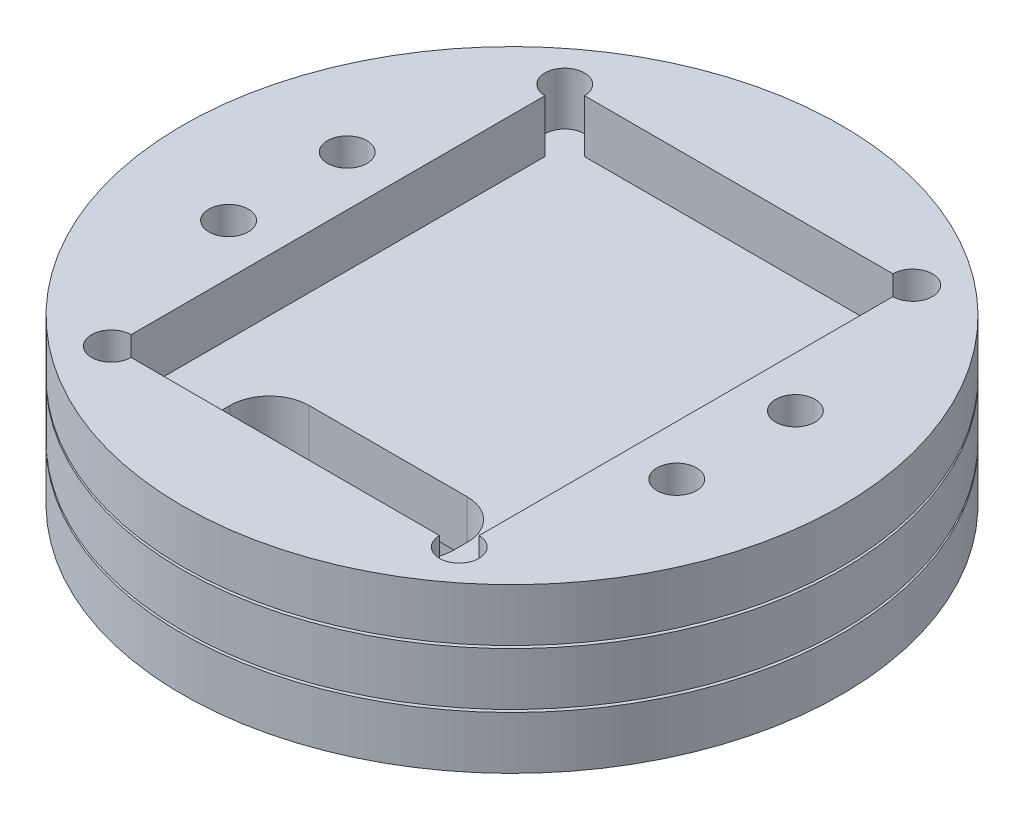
ISO-10303-21;
HEADER;
FILE_DESCRIPTION(('STEP AP214'),'2;1');
FILE_NAME('part.step','',(''),(''),'','','');
FILE_SCHEMA(('AUTOMOTIVE_DESIGN { 1 0 10303 214 1 1 1 1 }'));
ENDSEC;
DATA;
#1=APPLICATION_CONTEXT('core data for automotive mechanical design processes');
#2=APPLICATION_PROTOCOL_DEFINITION('international standard','automotive_design',2000,#1);
#3=PRODUCT_CONTEXT('',#1,'mechanical');
#4=PRODUCT('Part','Part','',(#3));
#5=PRODUCT_RELATED_PRODUCT_CATEGORY('part','',(#4));
#6=PRODUCT_DEFINITION_FORMATION('','',#4);
#7=PRODUCT_DEFINITION_CONTEXT('part definition',#1,'design');
#8=PRODUCT_DEFINITION('design','',#6,#7);
#9=PRODUCT_DEFINITION_SHAPE('','',#8);
#10=(LENGTH_UNIT() NAMED_UNIT(*) SI_UNIT(.MILLI.,.METRE.));
#11=(NAMED_UNIT(*) PLANE_ANGLE_UNIT() SI_UNIT($,.RADIAN.));
#12=(NAMED_UNIT(*) SI_UNIT($,.STERADIAN.) SOLID_ANGLE_UNIT());
#13=UNCERTAINTY_MEASURE_WITH_UNIT(LENGTH_MEASURE(1.E-05),#10,'distance_accuracy_value','');
#14=(GEOMETRIC_REPRESENTATION_CONTEXT(3) GLOBAL_UNCERTAINTY_ASSIGNED_CONTEXT((#13)) GLOBAL_UNIT_ASSIGNED_CONTEXT((#10,
#11,#12)) REPRESENTATION_CONTEXT('',''));
#15=CARTESIAN_POINT('',(0.,0.,0.));
#16=DIRECTION('',(0.,0.,1.));
#17=DIRECTION('',(1.,0.,0.));
#18=AXIS2_PLACEMENT_3D('',#15,#16,#17);
#19=CARTESIAN_POINT('',(0.,1.0414,0.));
#20=DIRECTION('',(0.,1.,0.));
#21=DIRECTION('',(0.,0.,1.));
#22=AXIS2_PLACEMENT_3D('',#19,#20,#21);
#23=PLANE('',#22);
#24=CARTESIAN_POINT('',(2.159,1.0414,-0.5715));
#25=DIRECTION('',(0.,1.,0.));
#26=DIRECTION('',(0.,0.,1.));
#27=AXIS2_PLACEMENT_3D('',#24,#25,#26);
#28=CIRCLE('',#27,0.1905);
#29=CARTESIAN_POINT('',(2.159,1.0414,-0.381));
#30=VERTEX_POINT('',#29);
#31=EDGE_CURVE('E322',#30,#30,#28,.T.);
#32=ORIENTED_EDGE('',*,*,#31,.F.);
#33=EDGE_LOOP('',(#32));
#34=FACE_BOUND('',#33,.T.);
#35=CARTESIAN_POINT('',(-2.159,1.0414,-0.5715));
#36=DIRECTION('',(0.,1.,0.));
#37=DIRECTION('',(0.,0.,1.));
#38=AXIS2_PLACEMENT_3D('',#35,#36,#37);
#39=CIRCLE('',#38,0.1905);
#40=CARTESIAN_POINT('',(-2.159,1.0414,-0.381));
#41=VERTEX_POINT('',#40);
#42=EDGE_CURVE('E147',#41,#41,#39,.T.);
#43=ORIENTED_EDGE('',*,*,#42,.F.);
#44=EDGE_LOOP('',(#43));
#45=FACE_BOUND('',#44,.T.);
#46=CARTESIAN_POINT('',(0.,1.0414,0.));
#47=DIRECTION('',(0.,1.,0.));
#48=DIRECTION('',(0.,0.,1.));
#49=AXIS2_PLACEMENT_3D('',#46,#47,#48);
#50=CIRCLE('',#49,3.175);
#51=CARTESIAN_POINT('',(0.,1.0414,3.175));
#52=VERTEX_POINT('',#51);
#53=EDGE_CURVE('E12',#52,#52,#50,.T.);
#54=ORIENTED_EDGE('',*,*,#53,.T.);
#55=EDGE_LOOP('',(#54));
#56=FACE_BOUND('',#55,.T.);
#57=DIRECTION('',(0.,0.,-1.));
#58=VECTOR('',#57,1.);
#59=CARTESIAN_POINT('',(1.6764,1.0414,1.9939));
#60=LINE('',#59,#58);
#61=CARTESIAN_POINT('',(1.6764,1.0414,1.9939));
#62=VERTEX_POINT('',#61);
#63=CARTESIAN_POINT('',(1.6764,1.0414,-1.9939));
#64=VERTEX_POINT('',#63);
#65=EDGE_CURVE('E118',#62,#64,#60,.T.);
#66=ORIENTED_EDGE('',*,*,#65,.F.);
#67=CARTESIAN_POINT('',(1.6764,1.0414,2.1844));
#68=DIRECTION('',(0.,1.,0.));
#69=DIRECTION('',(0.,0.,1.));
#70=AXIS2_PLACEMENT_3D('',#67,#68,#69);
#71=CIRCLE('',#70,0.1905);
#72=CARTESIAN_POINT('',(1.4859,1.0414,2.1844));
#73=VERTEX_POINT('',#72);
#74=EDGE_CURVE('E110',#73,#62,#71,.T.);
#75=ORIENTED_EDGE('',*,*,#74,.F.);
#76=DIRECTION('',(1.,0.,0.));
#77=VECTOR('',#76,1.);
#78=CARTESIAN_POINT('',(-1.4859,1.0414,2.1844));
#79=LINE('',#78,#77);
#80=CARTESIAN_POINT('',(-1.4859,1.0414,2.1844));
#81=VERTEX_POINT('',#80);
#82=EDGE_CURVE('E144',#81,#73,#79,.T.);
#83=ORIENTED_EDGE('',*,*,#82,.F.);
#84=CARTESIAN_POINT('',(-1.6764,1.0414,2.1844));
#85=DIRECTION('',(0.,1.,0.));
#86=DIRECTION('',(0.,0.,1.));
#87=AXIS2_PLACEMENT_3D('',#84,#85,#86);
#88=CIRCLE('',#87,0.1905);
#89=CARTESIAN_POINT('',(-1.6764,1.0414,1.9939));
#90=VERTEX_POINT('',#89);
#91=EDGE_CURVE('E142',#90,#81,#88,.T.);
#92=ORIENTED_EDGE('',*,*,#91,.F.);
#93=DIRECTION('',(0.,0.,1.));
#94=VECTOR('',#93,1.);
#95=CARTESIAN_POINT('',(-1.6764,1.0414,-1.9939));
#96=LINE('',#95,#94);
#97=CARTESIAN_POINT('',(-1.6764,1.0414,-1.9939));
#98=VERTEX_POINT('',#97);
#99=EDGE_CURVE('E140',#98,#90,#96,.T.);
#100=ORIENTED_EDGE('',*,*,#99,.F.);
#101=CARTESIAN_POINT('',(-1.6764,1.0414,-2.1844));
#102=DIRECTION('',(0.,1.,0.));
#103=DIRECTION('',(0.,0.,1.));
#104=AXIS2_PLACEMENT_3D('',#101,#102,#103);
#105=CIRCLE('',#104,0.1905);
#106=CARTESIAN_POINT('',(-1.4859,1.0414,-2.1844));
#107=VERTEX_POINT('',#106);
#108=EDGE_CURVE('E138',#107,#98,#105,.T.);
#109=ORIENTED_EDGE('',*,*,#108,.F.);
#110=DIRECTION('',(-1.,0.,0.));
#111=VECTOR('',#110,1.);
#112=CARTESIAN_POINT('',(1.4859,1.0414,-2.1844));
#113=LINE('',#112,#111);
#114=CARTESIAN_POINT('',(1.4859,1.0414,-2.1844));
#115=VERTEX_POINT('',#114);
#116=EDGE_CURVE('E133',#115,#107,#113,.T.);
#117=ORIENTED_EDGE('',*,*,#116,.F.);
#118=CARTESIAN_POINT('',(1.6764,1.0414,-2.1844));
#119=DIRECTION('',(0.,1.,0.));
#120=DIRECTION('',(0.,0.,1.));
#121=AXIS2_PLACEMENT_3D('',#118,#119,#120);
#122=CIRCLE('',#121,0.1905);
#123=EDGE_CURVE('E131',#64,#115,#122,.T.);
#124=ORIENTED_EDGE('',*,*,#123,.F.);
#125=EDGE_LOOP('',(#66,#75,#83,#92,#100,#109,#117,#124));
#126=FACE_BOUND('',#125,.T.);
#127=CARTESIAN_POINT('',(-2.159,1.0414,0.5715));
#128=DIRECTION('',(0.,1.,0.));
#129=DIRECTION('',(0.,0.,1.));
#130=AXIS2_PLACEMENT_3D('',#127,#128,#129);
#131=CIRCLE('',#130,0.1905);
#132=CARTESIAN_POINT('',(-2.159,1.0414,0.762));
#133=VERTEX_POINT('',#132);
#134=EDGE_CURVE('E328',#133,#133,#131,.T.);
#135=ORIENTED_EDGE('',*,*,#134,.F.);
#136=EDGE_LOOP('',(#135));
#137=FACE_BOUND('',#136,.T.);
#138=CARTESIAN_POINT('',(2.159,1.0414,0.5715));
#139=DIRECTION('',(0.,1.,0.));
#140=DIRECTION('',(0.,0.,1.));
#141=AXIS2_PLACEMENT_3D('',#138,#139,#140);
#142=CIRCLE('',#141,0.1905);
#143=CARTESIAN_POINT('',(2.159,1.0414,0.762));
#144=VERTEX_POINT('',#143);
#145=EDGE_CURVE('E313',#144,#144,#142,.T.);
#146=ORIENTED_EDGE('',*,*,#145,.F.);
#147=EDGE_LOOP('',(#146));
#148=FACE_BOUND('',#147,.T.);
#149=ADVANCED_FACE('F45',(#34,#45,#56,#126,#137,#148),#23,.T.);
#150=CARTESIAN_POINT('',(0.,0.5334,0.));
#151=DIRECTION('',(0.,1.,0.));
#152=DIRECTION('',(0.,0.,1.));
#153=AXIS2_PLACEMENT_3D('',#150,#151,#152);
#154=PLANE('',#153);
#155=CARTESIAN_POINT('',(2.159,0.5334,-0.5715));
#156=DIRECTION('',(0.,1.,0.));
#157=DIRECTION('',(0.,0.,1.));
#158=AXIS2_PLACEMENT_3D('',#155,#156,#157);
#159=CIRCLE('',#158,0.1905);
#160=CARTESIAN_POINT('',(2.159,0.5334,-0.381));
#161=VERTEX_POINT('',#160);
#162=EDGE_CURVE('E319',#161,#161,#159,.T.);
#163=ORIENTED_EDGE('',*,*,#162,.T.);
#164=EDGE_LOOP('',(#163));
#165=FACE_BOUND('',#164,.T.);
#166=CARTESIAN_POINT('',(-2.159,0.5334,-0.5715));
#167=DIRECTION('',(0.,1.,0.));
#168=DIRECTION('',(0.,0.,1.));
#169=AXIS2_PLACEMENT_3D('',#166,#167,#168);
#170=CIRCLE('',#169,0.1905);
#171=CARTESIAN_POINT('',(-2.159,0.5334,-0.381));
#172=VERTEX_POINT('',#171);
#173=EDGE_CURVE('E331',#172,#172,#170,.T.);
#174=ORIENTED_EDGE('',*,*,#173,.T.);
#175=EDGE_LOOP('',(#174));
#176=FACE_BOUND('',#175,.T.);
#177=CARTESIAN_POINT('',(0.,0.5334,0.));
#178=DIRECTION('',(0.,1.,0.));
#179=DIRECTION('',(0.,0.,1.));
#180=AXIS2_PLACEMENT_3D('',#177,#178,#179);
#181=CIRCLE('',#180,3.175);
#182=CARTESIAN_POINT('',(0.,0.5334,3.175));
#183=VERTEX_POINT('',#182);
#184=EDGE_CURVE('E49',#183,#183,#181,.T.);
#185=ORIENTED_EDGE('',*,*,#184,.F.);
#186=EDGE_LOOP('',(#185));
#187=FACE_BOUND('',#186,.T.);
#188=CARTESIAN_POINT('',(1.6764,0.5334,2.1844));
#189=DIRECTION('',(0.,1.,0.));
#190=DIRECTION('',(0.,0.,1.));
#191=AXIS2_PLACEMENT_3D('',#188,#189,#190);
#192=CIRCLE('',#191,0.1905);
#193=CARTESIAN_POINT('',(1.4859,0.5334,2.1844));
#194=VERTEX_POINT('',#193);
#195=CARTESIAN_POINT('',(1.6764,0.5334,1.9939));
#196=VERTEX_POINT('',#195);
#197=EDGE_CURVE('E68',#194,#196,#192,.T.);
#198=ORIENTED_EDGE('',*,*,#197,.T.);
#199=DIRECTION('',(0.,0.,-1.));
#200=VECTOR('',#199,1.);
#201=CARTESIAN_POINT('',(1.6764,0.5334,1.9939));
#202=LINE('',#201,#200);
#203=CARTESIAN_POINT('',(1.6764,0.5334,-1.9939));
#204=VERTEX_POINT('',#203);
#205=EDGE_CURVE('E125',#196,#204,#202,.T.);
#206=ORIENTED_EDGE('',*,*,#205,.T.);
#207=CARTESIAN_POINT('',(1.6764,0.5334,-2.1844));
#208=DIRECTION('',(0.,1.,0.));
#209=DIRECTION('',(0.,0.,1.));
#210=AXIS2_PLACEMENT_3D('',#207,#208,#209);
#211=CIRCLE('',#210,0.1905);
#212=CARTESIAN_POINT('',(1.4859,0.5334,-2.1844));
#213=VERTEX_POINT('',#212);
#214=EDGE_CURVE('E149',#204,#213,#211,.T.);
#215=ORIENTED_EDGE('',*,*,#214,.T.);
#216=DIRECTION('',(-1.,0.,0.));
#217=VECTOR('',#216,1.);
#218=CARTESIAN_POINT('',(1.4859,0.5334,-2.1844));
#219=LINE('',#218,#217);
#220=CARTESIAN_POINT('',(-1.4859,0.5334,-2.1844));
#221=VERTEX_POINT('',#220);
#222=EDGE_CURVE('E152',#213,#221,#219,.T.);
#223=ORIENTED_EDGE('',*,*,#222,.T.);
#224=CARTESIAN_POINT('',(-1.6764,0.5334,-2.1844));
#225=DIRECTION('',(0.,1.,0.));
#226=DIRECTION('',(0.,0.,1.));
#227=AXIS2_PLACEMENT_3D('',#224,#225,#226);
#228=CIRCLE('',#227,0.1905);
#229=CARTESIAN_POINT('',(-1.6764,0.5334,-1.9939));
#230=VERTEX_POINT('',#229);
#231=EDGE_CURVE('E155',#221,#230,#228,.T.);
#232=ORIENTED_EDGE('',*,*,#231,.T.);
#233=DIRECTION('',(0.,0.,1.));
#234=VECTOR('',#233,1.);
#235=CARTESIAN_POINT('',(-1.6764,0.5334,-1.9939));
#236=LINE('',#235,#234);
#237=CARTESIAN_POINT('',(-1.6764,0.5334,1.9939));
#238=VERTEX_POINT('',#237);
#239=EDGE_CURVE('E158',#230,#238,#236,.T.);
#240=ORIENTED_EDGE('',*,*,#239,.T.);
#241=CARTESIAN_POINT('',(-1.6764,0.5334,2.1844));
#242=DIRECTION('',(0.,1.,0.));
#243=DIRECTION('',(0.,0.,1.));
#244=AXIS2_PLACEMENT_3D('',#241,#242,#243);
#245=CIRCLE('',#244,0.1905);
#246=CARTESIAN_POINT('',(-1.4859,0.5334,2.1844));
#247=VERTEX_POINT('',#246);
#248=EDGE_CURVE('E161',#238,#247,#245,.T.);
#249=ORIENTED_EDGE('',*,*,#248,.T.);
#250=DIRECTION('',(1.,0.,0.));
#251=VECTOR('',#250,1.);
#252=CARTESIAN_POINT('',(-1.4859,0.5334,2.1844));
#253=LINE('',#252,#251);
#254=EDGE_CURVE('E119',#247,#194,#253,.T.);
#255=ORIENTED_EDGE('',*,*,#254,.T.);
#256=EDGE_LOOP('',(#198,#206,#215,#223,#232,#240,#249,#255));
#257=FACE_BOUND('',#256,.T.);
#258=CARTESIAN_POINT('',(-2.159,0.5334,0.5715));
#259=DIRECTION('',(0.,1.,0.));
#260=DIRECTION('',(0.,0.,1.));
#261=AXIS2_PLACEMENT_3D('',#258,#259,#260);
#262=CIRCLE('',#261,0.1905);
#263=CARTESIAN_POINT('',(-2.159,0.5334,0.762));
#264=VERTEX_POINT('',#263);
#265=EDGE_CURVE('E325',#264,#264,#262,.T.);
#266=ORIENTED_EDGE('',*,*,#265,.T.);
#267=EDGE_LOOP('',(#266));
#268=FACE_BOUND('',#267,.T.);
#269=CARTESIAN_POINT('',(2.159,0.5334,0.5715));
#270=DIRECTION('',(0.,1.,0.));
#271=DIRECTION('',(0.,0.,1.));
#272=AXIS2_PLACEMENT_3D('',#269,#270,#271);
#273=CIRCLE('',#272,0.1905);
#274=CARTESIAN_POINT('',(2.159,0.5334,0.762));
#275=VERTEX_POINT('',#274);
#276=EDGE_CURVE('E316',#275,#275,#273,.T.);
#277=ORIENTED_EDGE('',*,*,#276,.T.);
#278=EDGE_LOOP('',(#277));
#279=FACE_BOUND('',#278,.T.);
#280=ADVANCED_FACE('F182',(#165,#176,#187,#257,#268,#279),#154,.F.);
#281=CARTESIAN_POINT('',(0.,1.0414,0.));
#282=DIRECTION('',(0.,-1.,0.));
#283=DIRECTION('',(0.,0.,-1.));
#284=AXIS2_PLACEMENT_3D('',#281,#282,#283);
#285=CYLINDRICAL_SURFACE('',#284,3.175);
#286=ORIENTED_EDGE('',*,*,#53,.F.);
#287=EDGE_LOOP('',(#286));
#288=FACE_BOUND('',#287,.T.);
#289=ORIENTED_EDGE('',*,*,#184,.T.);
#290=EDGE_LOOP('',(#289));
#291=FACE_BOUND('',#290,.T.);
#292=ADVANCED_FACE('F47',(#288,#291),#285,.T.);
#293=CARTESIAN_POINT('',(1.6764,1.0414,2.1844));
#294=DIRECTION('',(0.,-1.,0.));
#295=DIRECTION('',(0.,0.,-1.));
#296=AXIS2_PLACEMENT_3D('',#293,#294,#295);
#297=CYLINDRICAL_SURFACE('',#296,0.1905);
#298=ORIENTED_EDGE('',*,*,#197,.F.);
#299=DIRECTION('',(0.,-1.,0.));
#300=VECTOR('',#299,1.);
#301=CARTESIAN_POINT('',(1.4859,1.0414,2.1844));
#302=LINE('',#301,#300);
#303=EDGE_CURVE('E114',#73,#194,#302,.T.);
#304=ORIENTED_EDGE('',*,*,#303,.F.);
#305=ORIENTED_EDGE('',*,*,#74,.T.);
#306=DIRECTION('',(0.,-1.,0.));
#307=VECTOR('',#306,1.);
#308=CARTESIAN_POINT('',(1.6764,1.0414,1.9939));
#309=LINE('',#308,#307);
#310=EDGE_CURVE('E113',#62,#196,#309,.T.);
#311=ORIENTED_EDGE('',*,*,#310,.T.);
#312=EDGE_LOOP('',(#298,#304,#305,#311));
#313=FACE_BOUND('',#312,.T.);
#314=ADVANCED_FACE('F112',(#313),#297,.F.);
#315=CARTESIAN_POINT('',(1.6764,1.0414,1.9939));
#316=DIRECTION('',(-1.,0.,0.));
#317=DIRECTION('',(0.,0.,1.));
#318=AXIS2_PLACEMENT_3D('',#315,#316,#317);
#319=PLANE('',#318);
#320=ORIENTED_EDGE('',*,*,#205,.F.);
#321=ORIENTED_EDGE('',*,*,#310,.F.);
#322=ORIENTED_EDGE('',*,*,#65,.T.);
#323=DIRECTION('',(0.,-1.,0.));
#324=VECTOR('',#323,1.);
#325=CARTESIAN_POINT('',(1.6764,1.0414,-1.9939));
#326=LINE('',#325,#324);
#327=EDGE_CURVE('E126',#64,#204,#326,.T.);
#328=ORIENTED_EDGE('',*,*,#327,.T.);
#329=EDGE_LOOP('',(#320,#321,#322,#328));
#330=FACE_BOUND('',#329,.T.);
#331=ADVANCED_FACE('F122',(#330),#319,.T.);
#332=CARTESIAN_POINT('',(1.6764,1.0414,-2.1844));
#333=DIRECTION('',(0.,-1.,0.));
#334=DIRECTION('',(0.,0.,-1.));
#335=AXIS2_PLACEMENT_3D('',#332,#333,#334);
#336=CYLINDRICAL_SURFACE('',#335,0.1905);
#337=ORIENTED_EDGE('',*,*,#214,.F.);
#338=ORIENTED_EDGE('',*,*,#327,.F.);
#339=ORIENTED_EDGE('',*,*,#123,.T.);
#340=DIRECTION('',(0.,-1.,0.));
#341=VECTOR('',#340,1.);
#342=CARTESIAN_POINT('',(1.4859,1.0414,-2.1844));
#343=LINE('',#342,#341);
#344=EDGE_CURVE('E174',#115,#213,#343,.T.);
#345=ORIENTED_EDGE('',*,*,#344,.T.);
#346=EDGE_LOOP('',(#337,#338,#339,#345));
#347=FACE_BOUND('',#346,.T.);
#348=ADVANCED_FACE('F178',(#347),#336,.F.);
#349=CARTESIAN_POINT('',(1.4859,1.0414,-2.1844));
#350=DIRECTION('',(0.,0.,1.));
#351=DIRECTION('',(1.,0.,0.));
#352=AXIS2_PLACEMENT_3D('',#349,#350,#351);
#353=PLANE('',#352);
#354=ORIENTED_EDGE('',*,*,#222,.F.);
#355=ORIENTED_EDGE('',*,*,#344,.F.);
#356=ORIENTED_EDGE('',*,*,#116,.T.);
#357=DIRECTION('',(0.,-1.,0.));
#358=VECTOR('',#357,1.);
#359=CARTESIAN_POINT('',(-1.4859,1.0414,-2.1844));
#360=LINE('',#359,#358);
#361=EDGE_CURVE('E172',#107,#221,#360,.T.);
#362=ORIENTED_EDGE('',*,*,#361,.T.);
#363=EDGE_LOOP('',(#354,#355,#356,#362));
#364=FACE_BOUND('',#363,.T.);
#365=ADVANCED_FACE('F201',(#364),#353,.T.);
#366=CARTESIAN_POINT('',(-1.6764,1.0414,-2.1844));
#367=DIRECTION('',(0.,-1.,0.));
#368=DIRECTION('',(0.,0.,-1.));
#369=AXIS2_PLACEMENT_3D('',#366,#367,#368);
#370=CYLINDRICAL_SURFACE('',#369,0.1905);
#371=ORIENTED_EDGE('',*,*,#231,.F.);
#372=ORIENTED_EDGE('',*,*,#361,.F.);
#373=ORIENTED_EDGE('',*,*,#108,.T.);
#374=DIRECTION('',(0.,-1.,0.));
#375=VECTOR('',#374,1.);
#376=CARTESIAN_POINT('',(-1.6764,1.0414,-1.9939));
#377=LINE('',#376,#375);
#378=EDGE_CURVE('E170',#98,#230,#377,.T.);
#379=ORIENTED_EDGE('',*,*,#378,.T.);
#380=EDGE_LOOP('',(#371,#372,#373,#379));
#381=FACE_BOUND('',#380,.T.);
#382=ADVANCED_FACE('F198',(#381),#370,.F.);
#383=CARTESIAN_POINT('',(-1.6764,1.0414,-1.9939));
#384=DIRECTION('',(1.,0.,0.));
#385=DIRECTION('',(0.,0.,-1.));
#386=AXIS2_PLACEMENT_3D('',#383,#384,#385);
#387=PLANE('',#386);
#388=ORIENTED_EDGE('',*,*,#239,.F.);
#389=ORIENTED_EDGE('',*,*,#378,.F.);
#390=ORIENTED_EDGE('',*,*,#99,.T.);
#391=DIRECTION('',(0.,-1.,0.));
#392=VECTOR('',#391,1.);
#393=CARTESIAN_POINT('',(-1.6764,1.0414,1.9939));
#394=LINE('',#393,#392);
#395=EDGE_CURVE('E168',#90,#238,#394,.T.);
#396=ORIENTED_EDGE('',*,*,#395,.T.);
#397=EDGE_LOOP('',(#388,#389,#390,#396));
#398=FACE_BOUND('',#397,.T.);
#399=ADVANCED_FACE('F194',(#398),#387,.T.);
#400=CARTESIAN_POINT('',(-1.6764,1.0414,2.1844));
#401=DIRECTION('',(0.,-1.,0.));
#402=DIRECTION('',(0.,0.,-1.));
#403=AXIS2_PLACEMENT_3D('',#400,#401,#402);
#404=CYLINDRICAL_SURFACE('',#403,0.1905);
#405=ORIENTED_EDGE('',*,*,#248,.F.);
#406=ORIENTED_EDGE('',*,*,#395,.F.);
#407=ORIENTED_EDGE('',*,*,#91,.T.);
#408=DIRECTION('',(0.,-1.,0.));
#409=VECTOR('',#408,1.);
#410=CARTESIAN_POINT('',(-1.4859,1.0414,2.1844));
#411=LINE('',#410,#409);
#412=EDGE_CURVE('E60',#81,#247,#411,.T.);
#413=ORIENTED_EDGE('',*,*,#412,.T.);
#414=EDGE_LOOP('',(#405,#406,#407,#413));
#415=FACE_BOUND('',#414,.T.);
#416=ADVANCED_FACE('F191',(#415),#404,.F.);
#417=CARTESIAN_POINT('',(-1.4859,1.0414,2.1844));
#418=DIRECTION('',(0.,0.,-1.));
#419=DIRECTION('',(-1.,0.,0.));
#420=AXIS2_PLACEMENT_3D('',#417,#418,#419);
#421=PLANE('',#420);
#422=ORIENTED_EDGE('',*,*,#254,.F.);
#423=ORIENTED_EDGE('',*,*,#412,.F.);
#424=ORIENTED_EDGE('',*,*,#82,.T.);
#425=ORIENTED_EDGE('',*,*,#303,.T.);
#426=EDGE_LOOP('',(#422,#423,#424,#425));
#427=FACE_BOUND('',#426,.T.);
#428=ADVANCED_FACE('F185',(#427),#421,.T.);
#429=CARTESIAN_POINT('',(-2.159,1.0414,-0.5715));
#430=DIRECTION('',(0.,-1.,0.));
#431=DIRECTION('',(0.,0.,-1.));
#432=AXIS2_PLACEMENT_3D('',#429,#430,#431);
#433=CYLINDRICAL_SURFACE('',#432,0.1905);
#434=ORIENTED_EDGE('',*,*,#42,.T.);
#435=EDGE_LOOP('',(#434));
#436=FACE_BOUND('',#435,.T.);
#437=ORIENTED_EDGE('',*,*,#173,.F.);
#438=EDGE_LOOP('',(#437));
#439=FACE_BOUND('',#438,.T.);
#440=ADVANCED_FACE('F267',(#436,#439),#433,.F.);
#441=CARTESIAN_POINT('',(-2.159,1.0414,0.5715));
#442=DIRECTION('',(0.,-1.,0.));
#443=DIRECTION('',(0.,0.,-1.));
#444=AXIS2_PLACEMENT_3D('',#441,#442,#443);
#445=CYLINDRICAL_SURFACE('',#444,0.1905);
#446=ORIENTED_EDGE('',*,*,#134,.T.);
#447=EDGE_LOOP('',(#446));
#448=FACE_BOUND('',#447,.T.);
#449=ORIENTED_EDGE('',*,*,#265,.F.);
#450=EDGE_LOOP('',(#449));
#451=FACE_BOUND('',#450,.T.);
#452=ADVANCED_FACE('F276',(#448,#451),#445,.F.);
#453=CARTESIAN_POINT('',(2.159,1.0414,-0.5715));
#454=DIRECTION('',(0.,-1.,0.));
#455=DIRECTION('',(0.,0.,-1.));
#456=AXIS2_PLACEMENT_3D('',#453,#454,#455);
#457=CYLINDRICAL_SURFACE('',#456,0.1905);
#458=ORIENTED_EDGE('',*,*,#31,.T.);
#459=EDGE_LOOP('',(#458));
#460=FACE_BOUND('',#459,.T.);
#461=ORIENTED_EDGE('',*,*,#162,.F.);
#462=EDGE_LOOP('',(#461));
#463=FACE_BOUND('',#462,.T.);
#464=ADVANCED_FACE('F286',(#460,#463),#457,.F.);
#465=CARTESIAN_POINT('',(2.159,1.0414,0.5715));
#466=DIRECTION('',(0.,-1.,0.));
#467=DIRECTION('',(0.,0.,-1.));
#468=AXIS2_PLACEMENT_3D('',#465,#466,#467);
#469=CYLINDRICAL_SURFACE('',#468,0.1905);
#470=ORIENTED_EDGE('',*,*,#145,.T.);
#471=EDGE_LOOP('',(#470));
#472=FACE_BOUND('',#471,.T.);
#473=ORIENTED_EDGE('',*,*,#276,.F.);
#474=EDGE_LOOP('',(#473));
#475=FACE_BOUND('',#474,.T.);
#476=ADVANCED_FACE('F296',(#472,#475),#469,.F.);
#477=CLOSED_SHELL('',(#149,#280,#292,#314,#331,#348,#365,#382,#399,#416,#428,#440,#452,#464,#476));
#478=MANIFOLD_SOLID_BREP('B2',#477);
#479=CARTESIAN_POINT('',(0.,-0.5334,0.));
#480=DIRECTION('',(0.,-1.,0.));
#481=DIRECTION('',(0.,0.,-1.));
#482=AXIS2_PLACEMENT_3D('',#479,#480,#481);
#483=PLANE('',#482);
#484=CARTESIAN_POINT('',(2.159,-0.5334,-0.5715));
#485=DIRECTION('',(0.,-1.,0.));
#486=DIRECTION('',(0.,0.,-1.));
#487=AXIS2_PLACEMENT_3D('',#484,#485,#486);
#488=CIRCLE('',#487,0.381);
#489=CARTESIAN_POINT('',(2.159,-0.5334,-0.9525));
#490=VERTEX_POINT('',#489);
#491=EDGE_CURVE('E1976',#490,#490,#488,.T.);
#492=ORIENTED_EDGE('',*,*,#491,.F.);
#493=EDGE_LOOP('',(#492));
#494=FACE_BOUND('',#493,.T.);
#495=CARTESIAN_POINT('',(-2.159,-0.5334,-0.5715));
#496=DIRECTION('',(0.,-1.,0.));
#497=DIRECTION('',(0.,0.,-1.));
#498=AXIS2_PLACEMENT_3D('',#495,#496,#497);
#499=CIRCLE('',#498,0.380999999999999);
#500=CARTESIAN_POINT('',(-2.159,-0.5334,-0.952499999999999));
#501=VERTEX_POINT('',#500);
#502=EDGE_CURVE('E1958',#501,#501,#499,.T.);
#503=ORIENTED_EDGE('',*,*,#502,.F.);
#504=EDGE_LOOP('',(#503));
#505=FACE_BOUND('',#504,.T.);
#506=CARTESIAN_POINT('',(0.,-0.5334,0.));
#507=DIRECTION('',(0.,-1.,0.));
#508=DIRECTION('',(0.,0.,-1.));
#509=AXIS2_PLACEMENT_3D('',#506,#507,#508);
#510=CIRCLE('',#509,3.175);
#511=CARTESIAN_POINT('',(0.,-0.5334,-3.175));
#512=VERTEX_POINT('',#511);
#513=EDGE_CURVE('E784',#512,#512,#510,.T.);
#514=ORIENTED_EDGE('',*,*,#513,.T.);
#515=EDGE_LOOP('',(#514));
#516=FACE_BOUND('',#515,.T.);
#517=DIRECTION('',(-1.,0.,0.));
#518=VECTOR('',#517,1.);
#519=CARTESIAN_POINT('',(-0.888999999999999,-0.5334,2.667));
#520=LINE('',#519,#518);
#521=CARTESIAN_POINT('',(0.889000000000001,-0.5334,2.667));
#522=VERTEX_POINT('',#521);
#523=CARTESIAN_POINT('',(-0.888999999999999,-0.5334,2.667));
#524=VERTEX_POINT('',#523);
#525=EDGE_CURVE('E714',#522,#524,#520,.T.);
#526=ORIENTED_EDGE('',*,*,#525,.F.);
#527=CARTESIAN_POINT('',(0.889,-0.5334,2.286));
#528=DIRECTION('',(0.,-1.,0.));
#529=DIRECTION('',(0.,0.,1.));
#530=AXIS2_PLACEMENT_3D('',#527,#528,#529);
#531=CIRCLE('',#530,0.381);
#532=CARTESIAN_POINT('',(1.27,-0.5334,2.286));
#533=VERTEX_POINT('',#532);
#534=EDGE_CURVE('E704',#533,#522,#531,.T.);
#535=ORIENTED_EDGE('',*,*,#534,.F.);
#536=DIRECTION('',(0.,0.,1.));
#537=VECTOR('',#536,1.);
#538=CARTESIAN_POINT('',(1.27,-0.5334,2.286));
#539=LINE('',#538,#537);
#540=CARTESIAN_POINT('',(1.27,-0.5334,1.524));
#541=VERTEX_POINT('',#540);
#542=EDGE_CURVE('E742',#541,#533,#539,.T.);
#543=ORIENTED_EDGE('',*,*,#542,.F.);
#544=CARTESIAN_POINT('',(0.889000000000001,-0.5334,1.524));
#545=DIRECTION('',(0.,-1.,0.));
#546=DIRECTION('',(0.,0.,-1.));
#547=AXIS2_PLACEMENT_3D('',#544,#545,#546);
#548=CIRCLE('',#547,0.381);
#549=CARTESIAN_POINT('',(0.889000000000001,-0.5334,1.143));
#550=VERTEX_POINT('',#549);
#551=EDGE_CURVE('E739',#550,#541,#548,.T.);
#552=ORIENTED_EDGE('',*,*,#551,.F.);
#553=DIRECTION('',(1.,0.,0.));
#554=VECTOR('',#553,1.);
#555=CARTESIAN_POINT('',(-0.889,-0.5334,1.143));
#556=LINE('',#555,#554);
#557=CARTESIAN_POINT('',(-0.889,-0.5334,1.143));
#558=VERTEX_POINT('',#557);
#559=EDGE_CURVE('E737',#558,#550,#556,.T.);
#560=ORIENTED_EDGE('',*,*,#559,.F.);
#561=CARTESIAN_POINT('',(-0.889,-0.5334,1.524));
#562=DIRECTION('',(0.,-1.,0.));
#563=DIRECTION('',(0.,0.,-1.));
#564=AXIS2_PLACEMENT_3D('',#561,#562,#563);
#565=CIRCLE('',#564,0.381);
#566=CARTESIAN_POINT('',(-1.27,-0.5334,1.524));
#567=VERTEX_POINT('',#566);
#568=EDGE_CURVE('E735',#567,#558,#565,.T.);
#569=ORIENTED_EDGE('',*,*,#568,.F.);
#570=DIRECTION('',(0.,0.,-1.));
#571=VECTOR('',#570,1.);
#572=CARTESIAN_POINT('',(-1.27,-0.5334,2.286));
#573=LINE('',#572,#571);
#574=CARTESIAN_POINT('',(-1.27,-0.5334,2.286));
#575=VERTEX_POINT('',#574);
#576=EDGE_CURVE('E730',#575,#567,#573,.T.);
#577=ORIENTED_EDGE('',*,*,#576,.F.);
#578=CARTESIAN_POINT('',(-0.889,-0.5334,2.286));
#579=DIRECTION('',(0.,-1.,0.));
#580=DIRECTION('',(0.,0.,1.));
#581=AXIS2_PLACEMENT_3D('',#578,#579,#580);
#582=CIRCLE('',#581,0.381);
#583=EDGE_CURVE('E728',#524,#575,#582,.T.);
#584=ORIENTED_EDGE('',*,*,#583,.F.);
#585=EDGE_LOOP('',(#526,#535,#543,#552,#560,#569,#577,#584));
#586=FACE_BOUND('',#585,.T.);
#587=CARTESIAN_POINT('',(-2.159,-0.5334,0.5715));
#588=DIRECTION('',(0.,-1.,0.));
#589=DIRECTION('',(0.,0.,-1.));
#590=AXIS2_PLACEMENT_3D('',#587,#588,#589);
#591=CIRCLE('',#590,0.381);
#592=CARTESIAN_POINT('',(-2.159,-0.5334,0.1905));
#593=VERTEX_POINT('',#592);
#594=EDGE_CURVE('E1967',#593,#593,#591,.T.);
#595=ORIENTED_EDGE('',*,*,#594,.F.);
#596=EDGE_LOOP('',(#595));
#597=FACE_BOUND('',#596,.T.);
#598=CARTESIAN_POINT('',(2.159,-0.5334,0.5715));
#599=DIRECTION('',(0.,-1.,0.));
#600=DIRECTION('',(0.,0.,-1.));
#601=AXIS2_PLACEMENT_3D('',#598,#599,#600);
#602=CIRCLE('',#601,0.381);
#603=CARTESIAN_POINT('',(2.159,-0.5334,0.1905));
#604=VERTEX_POINT('',#603);
#605=EDGE_CURVE('E1985',#604,#604,#602,.T.);
#606=ORIENTED_EDGE('',*,*,#605,.F.);
#607=EDGE_LOOP('',(#606));
#608=FACE_BOUND('',#607,.T.);
#609=ADVANCED_FACE('F378',(#494,#505,#516,#586,#597,#608),#483,.T.);
#610=CARTESIAN_POINT('',(0.,0.,0.));
#611=DIRECTION('',(0.,1.,0.));
#612=DIRECTION('',(0.,0.,1.));
#613=AXIS2_PLACEMENT_3D('',#610,#611,#612);
#614=PLANE('',#613);
#615=DIRECTION('',(0.,0.,-1.));
#616=VECTOR('',#615,1.);
#617=CARTESIAN_POINT('',(0.5969,0.,2.0828));
#618=LINE('',#617,#616);
#619=CARTESIAN_POINT('',(0.5969,0.,2.3876));
#620=VERTEX_POINT('',#619);
#621=CARTESIAN_POINT('',(0.5969,0.,2.0828));
#622=VERTEX_POINT('',#621);
#623=EDGE_CURVE('E842',#620,#622,#618,.T.);
#624=ORIENTED_EDGE('',*,*,#623,.F.);
#625=DIRECTION('',(-1.,0.,0.));
#626=VECTOR('',#625,1.);
#627=CARTESIAN_POINT('',(0.5969,0.,2.3876));
#628=LINE('',#627,#626);
#629=CARTESIAN_POINT('',(0.762,0.,2.3876));
#630=VERTEX_POINT('',#629);
#631=EDGE_CURVE('E847',#630,#620,#628,.T.);
#632=ORIENTED_EDGE('',*,*,#631,.F.);
#633=CARTESIAN_POINT('',(0.762,0.,1.7018));
#634=DIRECTION('',(0.,-1.,0.));
#635=DIRECTION('',(0.,0.,1.));
#636=AXIS2_PLACEMENT_3D('',#633,#634,#635);
#637=CIRCLE('',#636,0.6858);
#638=CARTESIAN_POINT('',(1.4478,0.,1.7018));
#639=VERTEX_POINT('',#638);
#640=EDGE_CURVE('E892',#639,#630,#637,.T.);
#641=ORIENTED_EDGE('',*,*,#640,.F.);
#642=DIRECTION('',(0.,0.,1.));
#643=VECTOR('',#642,1.);
#644=CARTESIAN_POINT('',(1.4478,0.,1.7018));
#645=LINE('',#644,#643);
#646=CARTESIAN_POINT('',(1.4478,0.,-0.4191));
#647=VERTEX_POINT('',#646);
#648=EDGE_CURVE('E889',#647,#639,#645,.T.);
#649=ORIENTED_EDGE('',*,*,#648,.F.);
#650=DIRECTION('',(-1.,0.,0.));
#651=VECTOR('',#650,1.);
#652=CARTESIAN_POINT('',(1.80980773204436,0.,-0.4191));
#653=LINE('',#652,#651);
#654=CARTESIAN_POINT('',(1.80980773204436,0.,-0.4191));
#655=VERTEX_POINT('',#654);
#656=EDGE_CURVE('E886',#655,#647,#653,.T.);
#657=ORIENTED_EDGE('',*,*,#656,.F.);
#658=CARTESIAN_POINT('',(2.159,0.,-0.5715));
#659=DIRECTION('',(0.,-1.,0.));
#660=DIRECTION('',(0.,0.,-1.));
#661=AXIS2_PLACEMENT_3D('',#658,#659,#660);
#662=CIRCLE('',#661,0.381);
#663=CARTESIAN_POINT('',(1.80980773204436,0.,-0.7239));
#664=VERTEX_POINT('',#663);
#665=EDGE_CURVE('E883',#664,#655,#662,.T.);
#666=ORIENTED_EDGE('',*,*,#665,.F.);
#667=DIRECTION('',(1.,0.,0.));
#668=VECTOR('',#667,1.);
#669=CARTESIAN_POINT('',(1.80980773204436,0.,-0.7239));
#670=LINE('',#669,#668);
#671=CARTESIAN_POINT('',(1.143,0.,-0.7239));
#672=VERTEX_POINT('',#671);
#673=EDGE_CURVE('E880',#672,#664,#670,.T.);
#674=ORIENTED_EDGE('',*,*,#673,.F.);
#675=DIRECTION('',(0.,0.,-1.));
#676=VECTOR('',#675,1.);
#677=CARTESIAN_POINT('',(1.143,0.,1.7018));
#678=LINE('',#677,#676);
#679=CARTESIAN_POINT('',(1.143,0.,1.5748));
#680=VERTEX_POINT('',#679);
#681=EDGE_CURVE('E877',#680,#672,#678,.T.);
#682=ORIENTED_EDGE('',*,*,#681,.F.);
#683=CARTESIAN_POINT('',(0.762,0.,1.5748));
#684=DIRECTION('',(0.,1.,0.));
#685=DIRECTION('',(0.,0.,-1.));
#686=AXIS2_PLACEMENT_3D('',#683,#684,#685);
#687=CIRCLE('',#686,0.381);
#688=CARTESIAN_POINT('',(0.762,0.,1.1938));
#689=VERTEX_POINT('',#688);
#690=EDGE_CURVE('E1887',#680,#689,#687,.T.);
#691=ORIENTED_EDGE('',*,*,#690,.T.);
#692=DIRECTION('',(-1.,0.,0.));
#693=VECTOR('',#692,1.);
#694=CARTESIAN_POINT('',(-0.762,0.,1.1938));
#695=LINE('',#694,#693);
#696=CARTESIAN_POINT('',(-0.762,0.,1.1938));
#697=VERTEX_POINT('',#696);
#698=EDGE_CURVE('E1902',#689,#697,#695,.T.);
#699=ORIENTED_EDGE('',*,*,#698,.T.);
#700=CARTESIAN_POINT('',(-0.762,0.,1.5748));
#701=DIRECTION('',(0.,1.,0.));
#702=DIRECTION('',(0.,0.,-1.));
#703=AXIS2_PLACEMENT_3D('',#700,#701,#702);
#704=CIRCLE('',#703,0.381);
#705=CARTESIAN_POINT('',(-1.143,0.,1.5748));
#706=VERTEX_POINT('',#705);
#707=EDGE_CURVE('E1053',#697,#706,#704,.T.);
#708=ORIENTED_EDGE('',*,*,#707,.T.);
#709=DIRECTION('',(0.,0.,1.));
#710=VECTOR('',#709,1.);
#711=CARTESIAN_POINT('',(-1.143,0.,0.419099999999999));
#712=LINE('',#711,#710);
#713=CARTESIAN_POINT('',(-1.143,0.,0.419099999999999));
#714=VERTEX_POINT('',#713);
#715=EDGE_CURVE('E925',#714,#706,#712,.T.);
#716=ORIENTED_EDGE('',*,*,#715,.F.);
#717=DIRECTION('',(1.,0.,0.));
#718=VECTOR('',#717,1.);
#719=CARTESIAN_POINT('',(-1.80980773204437,0.,0.419099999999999));
#720=LINE('',#719,#718);
#721=CARTESIAN_POINT('',(-1.80980773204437,0.,0.419099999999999));
#722=VERTEX_POINT('',#721);
#723=EDGE_CURVE('E968',#722,#714,#720,.T.);
#724=ORIENTED_EDGE('',*,*,#723,.F.);
#725=CARTESIAN_POINT('',(-2.159,0.,0.5715));
#726=DIRECTION('',(0.,-1.,0.));
#727=DIRECTION('',(0.,0.,-1.));
#728=AXIS2_PLACEMENT_3D('',#725,#726,#727);
#729=CIRCLE('',#728,0.381);
#730=CARTESIAN_POINT('',(-1.80980773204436,0.,0.723899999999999));
#731=VERTEX_POINT('',#730);
#732=EDGE_CURVE('E965',#731,#722,#729,.T.);
#733=ORIENTED_EDGE('',*,*,#732,.F.);
#734=DIRECTION('',(-1.,0.,0.));
#735=VECTOR('',#734,1.);
#736=CARTESIAN_POINT('',(-1.80980773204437,0.,0.723899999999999));
#737=LINE('',#736,#735);
#738=CARTESIAN_POINT('',(-1.4478,0.,0.723899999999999));
#739=VERTEX_POINT('',#738);
#740=EDGE_CURVE('E962',#739,#731,#737,.T.);
#741=ORIENTED_EDGE('',*,*,#740,.F.);
#742=DIRECTION('',(0.,0.,-1.));
#743=VECTOR('',#742,1.);
#744=CARTESIAN_POINT('',(-1.4478,0.,0.723899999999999));
#745=LINE('',#744,#743);
#746=CARTESIAN_POINT('',(-1.4478,0.,1.7018));
#747=VERTEX_POINT('',#746);
#748=EDGE_CURVE('E959',#747,#739,#745,.T.);
#749=ORIENTED_EDGE('',*,*,#748,.F.);
#750=CARTESIAN_POINT('',(-0.762,0.,1.7018));
#751=DIRECTION('',(0.,-1.,0.));
#752=DIRECTION('',(0.,0.,1.));
#753=AXIS2_PLACEMENT_3D('',#750,#751,#752);
#754=CIRCLE('',#753,0.6858);
#755=CARTESIAN_POINT('',(-0.762,0.,2.3876));
#756=VERTEX_POINT('',#755);
#757=EDGE_CURVE('E956',#756,#747,#754,.T.);
#758=ORIENTED_EDGE('',*,*,#757,.F.);
#759=DIRECTION('',(-1.,0.,0.));
#760=VECTOR('',#759,1.);
#761=CARTESIAN_POINT('',(-0.5969,0.,2.3876));
#762=LINE('',#761,#760);
#763=CARTESIAN_POINT('',(-0.5969,0.,2.3876));
#764=VERTEX_POINT('',#763);
#765=EDGE_CURVE('E953',#764,#756,#762,.T.);
#766=ORIENTED_EDGE('',*,*,#765,.F.);
#767=DIRECTION('',(0.,0.,1.));
#768=VECTOR('',#767,1.);
#769=CARTESIAN_POINT('',(-0.5969,0.,2.0828));
#770=LINE('',#769,#768);
#771=CARTESIAN_POINT('',(-0.5969,0.,2.0828));
#772=VERTEX_POINT('',#771);
#773=EDGE_CURVE('E920',#772,#764,#770,.T.);
#774=ORIENTED_EDGE('',*,*,#773,.F.);
#775=DIRECTION('',(1.,0.,0.));
#776=VECTOR('',#775,1.);
#777=CARTESIAN_POINT('',(-0.762,0.,2.0828));
#778=LINE('',#777,#776);
#779=CARTESIAN_POINT('',(-0.3175,0.,2.0828));
#780=VERTEX_POINT('',#779);
#781=EDGE_CURVE('E382',#772,#780,#778,.T.);
#782=ORIENTED_EDGE('',*,*,#781,.T.);
#783=DIRECTION('',(0.,0.,-1.));
#784=VECTOR('',#783,1.);
#785=CARTESIAN_POINT('',(-0.3175,0.,2.0828));
#786=LINE('',#785,#784);
#787=CARTESIAN_POINT('',(-0.3175,0.,2.8956));
#788=VERTEX_POINT('',#787);
#789=EDGE_CURVE('E996',#788,#780,#786,.T.);
#790=ORIENTED_EDGE('',*,*,#789,.F.);
#791=DIRECTION('',(-1.,0.,0.));
#792=VECTOR('',#791,1.);
#793=CARTESIAN_POINT('',(-0.3175,0.,2.8956));
#794=LINE('',#793,#792);
#795=CARTESIAN_POINT('',(0.762,0.,2.8956));
#796=VERTEX_POINT('',#795);
#797=EDGE_CURVE('E1854',#796,#788,#794,.T.);
#798=ORIENTED_EDGE('',*,*,#797,.F.);
#799=CARTESIAN_POINT('',(0.762,0.,1.7018));
#800=DIRECTION('',(0.,-1.,0.));
#801=DIRECTION('',(0.,0.,-1.));
#802=AXIS2_PLACEMENT_3D('',#799,#800,#801);
#803=CIRCLE('',#802,1.1938);
#804=CARTESIAN_POINT('',(1.9558,0.,1.7018));
#805=VERTEX_POINT('',#804);
#806=EDGE_CURVE('E1932',#805,#796,#803,.T.);
#807=ORIENTED_EDGE('',*,*,#806,.F.);
#808=DIRECTION('',(0.,0.,1.));
#809=VECTOR('',#808,1.);
#810=CARTESIAN_POINT('',(1.9558,0.,1.7018));
#811=LINE('',#810,#809);
#812=CARTESIAN_POINT('',(1.9558,0.,0.893789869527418));
#813=VERTEX_POINT('',#812);
#814=EDGE_CURVE('E1934',#813,#805,#811,.T.);
#815=ORIENTED_EDGE('',*,*,#814,.F.);
#816=CARTESIAN_POINT('',(2.159,0.,0.5715));
#817=DIRECTION('',(0.,-1.,0.));
#818=DIRECTION('',(0.,0.,-1.));
#819=AXIS2_PLACEMENT_3D('',#816,#817,#818);
#820=CIRCLE('',#819,0.381);
#821=CARTESIAN_POINT('',(1.80980773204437,0.,0.419099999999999));
#822=VERTEX_POINT('',#821);
#823=EDGE_CURVE('E1935',#822,#813,#820,.T.);
#824=ORIENTED_EDGE('',*,*,#823,.F.);
#825=DIRECTION('',(1.,0.,0.));
#826=VECTOR('',#825,1.);
#827=CARTESIAN_POINT('',(1.651,0.,0.419099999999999));
#828=LINE('',#827,#826);
#829=CARTESIAN_POINT('',(1.651,0.,0.419099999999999));
#830=VERTEX_POINT('',#829);
#831=EDGE_CURVE('E1940',#830,#822,#828,.T.);
#832=ORIENTED_EDGE('',*,*,#831,.F.);
#833=DIRECTION('',(0.,0.,-1.));
#834=VECTOR('',#833,1.);
#835=CARTESIAN_POINT('',(1.651,0.,1.7018));
#836=LINE('',#835,#834);
#837=CARTESIAN_POINT('',(1.651,0.,1.7018));
#838=VERTEX_POINT('',#837);
#839=EDGE_CURVE('E1943',#838,#830,#836,.T.);
#840=ORIENTED_EDGE('',*,*,#839,.F.);
#841=CARTESIAN_POINT('',(0.762,0.,1.7018));
#842=DIRECTION('',(0.,1.,0.));
#843=DIRECTION('',(0.,0.,-1.));
#844=AXIS2_PLACEMENT_3D('',#841,#842,#843);
#845=CIRCLE('',#844,0.889);
#846=CARTESIAN_POINT('',(0.762,0.,2.5908));
#847=VERTEX_POINT('',#846);
#848=EDGE_CURVE('E1945',#847,#838,#845,.T.);
#849=ORIENTED_EDGE('',*,*,#848,.F.);
#850=DIRECTION('',(1.,0.,0.));
#851=VECTOR('',#850,1.);
#852=CARTESIAN_POINT('',(0.762,0.,2.5908));
#853=LINE('',#852,#851);
#854=CARTESIAN_POINT('',(0.3175,0.,2.5908));
#855=VERTEX_POINT('',#854);
#856=EDGE_CURVE('E1030',#855,#847,#853,.T.);
#857=ORIENTED_EDGE('',*,*,#856,.F.);
#858=DIRECTION('',(0.,0.,1.));
#859=VECTOR('',#858,1.);
#860=CARTESIAN_POINT('',(0.3175,0.,2.0828));
#861=LINE('',#860,#859);
#862=CARTESIAN_POINT('',(0.3175,0.,2.0828));
#863=VERTEX_POINT('',#862);
#864=EDGE_CURVE('E1034',#863,#855,#861,.T.);
#865=ORIENTED_EDGE('',*,*,#864,.F.);
#866=EDGE_CURVE('E1051',#863,#622,#778,.T.);
#867=ORIENTED_EDGE('',*,*,#866,.T.);
#868=EDGE_LOOP('',(#624,#632,#641,#649,#657,#666,#674,#682,#691,#699,#708,#716,#724,#733,#741,
#749,#758,#766,#774,#782,#790,#798,#807,#815,#824,#832,#840,#849,#857,#865,#867));
#869=FACE_BOUND('',#868,.T.);
#870=CARTESIAN_POINT('',(0.,0.,0.));
#871=DIRECTION('',(0.,1.,0.));
#872=DIRECTION('',(0.,0.,1.));
#873=AXIS2_PLACEMENT_3D('',#870,#871,#872);
#874=CIRCLE('',#873,3.175);
#875=CARTESIAN_POINT('',(0.,0.,3.175));
#876=VERTEX_POINT('',#875);
#877=EDGE_CURVE('E388',#876,#876,#874,.T.);
#878=ORIENTED_EDGE('',*,*,#877,.F.);
#879=EDGE_LOOP('',(#878));
#880=FACE_BOUND('',#879,.T.);
#881=CARTESIAN_POINT('',(-2.159,0.,-0.5715));
#882=DIRECTION('',(0.,-1.,0.));
#883=DIRECTION('',(0.,0.,-1.));
#884=AXIS2_PLACEMENT_3D('',#881,#882,#883);
#885=CIRCLE('',#884,0.381);
#886=CARTESIAN_POINT('',(-2.159,0.,-0.1905));
#887=VERTEX_POINT('',#886);
#888=CARTESIAN_POINT('',(-2.38272629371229,0.,-0.879895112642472));
#889=VERTEX_POINT('',#888);
#890=EDGE_CURVE('E797',#887,#889,#885,.T.);
#891=ORIENTED_EDGE('',*,*,#890,.F.);
#892=DIRECTION('',(-1.,0.,0.));
#893=VECTOR('',#892,1.);
#894=CARTESIAN_POINT('',(-2.159,0.,-0.1905));
#895=LINE('',#894,#893);
#896=CARTESIAN_POINT('',(-1.143,0.,-0.1905));
#897=VERTEX_POINT('',#896);
#898=EDGE_CURVE('E802',#897,#887,#895,.T.);
#899=ORIENTED_EDGE('',*,*,#898,.F.);
#900=DIRECTION('',(0.,0.,1.));
#901=VECTOR('',#900,1.);
#902=CARTESIAN_POINT('',(-1.143,0.,-0.1905));
#903=LINE('',#902,#901);
#904=CARTESIAN_POINT('',(-1.143,0.,-1.27));
#905=VERTEX_POINT('',#904);
#906=EDGE_CURVE('E823',#905,#897,#903,.T.);
#907=ORIENTED_EDGE('',*,*,#906,.F.);
#908=DIRECTION('',(-1.,0.,0.));
#909=VECTOR('',#908,1.);
#910=CARTESIAN_POINT('',(-1.143,0.,-1.27));
#911=LINE('',#910,#909);
#912=CARTESIAN_POINT('',(2.19970452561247,0.,-1.27));
#913=VERTEX_POINT('',#912);
#914=EDGE_CURVE('E820',#913,#905,#911,.T.);
#915=ORIENTED_EDGE('',*,*,#914,.F.);
#916=CARTESIAN_POINT('',(0.,0.,0.));
#917=DIRECTION('',(0.,-1.,0.));
#918=DIRECTION('',(0.,0.,-1.));
#919=AXIS2_PLACEMENT_3D('',#916,#917,#918);
#920=CIRCLE('',#919,2.54);
#921=EDGE_CURVE('E817',#889,#913,#920,.T.);
#922=ORIENTED_EDGE('',*,*,#921,.F.);
#923=EDGE_LOOP('',(#891,#899,#907,#915,#922));
#924=FACE_BOUND('',#923,.T.);
#925=ADVANCED_FACE('F1084',(#869,#880,#924),#614,.F.);
#926=CARTESIAN_POINT('',(0.,0.508,0.));
#927=DIRECTION('',(0.,1.,0.));
#928=DIRECTION('',(0.,0.,1.));
#929=AXIS2_PLACEMENT_3D('',#926,#927,#928);
#930=PLANE('',#929);
#931=CARTESIAN_POINT('',(-2.159,0.508,-0.5715));
#932=DIRECTION('',(0.,1.,0.));
#933=DIRECTION('',(0.,0.,1.));
#934=AXIS2_PLACEMENT_3D('',#931,#932,#933);
#935=CIRCLE('',#934,0.1905);
#936=CARTESIAN_POINT('',(-2.159,0.508,-0.381));
#937=VERTEX_POINT('',#936);
#938=EDGE_CURVE('E1040',#937,#937,#935,.T.);
#939=ORIENTED_EDGE('',*,*,#938,.F.);
#940=EDGE_LOOP('',(#939));
#941=FACE_BOUND('',#940,.T.);
#942=CARTESIAN_POINT('',(2.159,0.508,-0.5715));
#943=DIRECTION('',(0.,1.,0.));
#944=DIRECTION('',(0.,0.,1.));
#945=AXIS2_PLACEMENT_3D('',#942,#943,#944);
#946=CIRCLE('',#945,0.1905);
#947=CARTESIAN_POINT('',(2.159,0.508,-0.381));
#948=VERTEX_POINT('',#947);
#949=EDGE_CURVE('E1878',#948,#948,#946,.T.);
#950=ORIENTED_EDGE('',*,*,#949,.F.);
#951=EDGE_LOOP('',(#950));
#952=FACE_BOUND('',#951,.T.);
#953=CARTESIAN_POINT('',(-2.159,0.508,0.5715));
#954=DIRECTION('',(0.,1.,0.));
#955=DIRECTION('',(0.,0.,1.));
#956=AXIS2_PLACEMENT_3D('',#953,#954,#955);
#957=CIRCLE('',#956,0.1905);
#958=CARTESIAN_POINT('',(-2.159,0.508,0.762));
#959=VERTEX_POINT('',#958);
#960=EDGE_CURVE('E1881',#959,#959,#957,.T.);
#961=ORIENTED_EDGE('',*,*,#960,.F.);
#962=EDGE_LOOP('',(#961));
#963=FACE_BOUND('',#962,.T.);
#964=CARTESIAN_POINT('',(2.159,0.508,0.5715));
#965=DIRECTION('',(0.,1.,0.));
#966=DIRECTION('',(0.,0.,1.));
#967=AXIS2_PLACEMENT_3D('',#964,#965,#966);
#968=CIRCLE('',#967,0.1905);
#969=CARTESIAN_POINT('',(2.159,0.508,0.762));
#970=VERTEX_POINT('',#969);
#971=EDGE_CURVE('E1884',#970,#970,#968,.T.);
#972=ORIENTED_EDGE('',*,*,#971,.F.);
#973=EDGE_LOOP('',(#972));
#974=FACE_BOUND('',#973,.T.);
#975=CARTESIAN_POINT('',(0.,0.508,0.));
#976=DIRECTION('',(0.,1.,0.));
#977=DIRECTION('',(0.,0.,1.));
#978=AXIS2_PLACEMENT_3D('',#975,#976,#977);
#979=CIRCLE('',#978,3.175);
#980=CARTESIAN_POINT('',(0.,0.508,3.175));
#981=VERTEX_POINT('',#980);
#982=EDGE_CURVE('E43',#981,#981,#979,.T.);
#983=ORIENTED_EDGE('',*,*,#982,.T.);
#984=EDGE_LOOP('',(#983));
#985=FACE_BOUND('',#984,.T.);
#986=DIRECTION('',(0.,0.,-1.));
#987=VECTOR('',#986,1.);
#988=CARTESIAN_POINT('',(1.143,0.508,1.7018));
#989=LINE('',#988,#987);
#990=CARTESIAN_POINT('',(1.143,0.508,1.7018));
#991=VERTEX_POINT('',#990);
#992=CARTESIAN_POINT('',(1.143,0.508,1.5748));
#993=VERTEX_POINT('',#992);
#994=EDGE_CURVE('E1889',#991,#993,#989,.T.);
#995=ORIENTED_EDGE('',*,*,#994,.F.);
#996=CARTESIAN_POINT('',(0.762,0.508,1.7018));
#997=DIRECTION('',(0.,1.,0.));
#998=DIRECTION('',(0.,0.,1.));
#999=AXIS2_PLACEMENT_3D('',#996,#997,#998);
#1000=CIRCLE('',#999,0.381);
#1001=CARTESIAN_POINT('',(0.762,0.508,2.0828));
#1002=VERTEX_POINT('',#1001);
#1003=EDGE_CURVE('E1841',#1002,#991,#1000,.T.);
#1004=ORIENTED_EDGE('',*,*,#1003,.F.);
#1005=DIRECTION('',(1.,0.,0.));
#1006=VECTOR('',#1005,1.);
#1007=CARTESIAN_POINT('',(-0.762,0.508,2.0828));
#1008=LINE('',#1007,#1006);
#1009=CARTESIAN_POINT('',(-0.762,0.508,2.0828));
#1010=VERTEX_POINT('',#1009);
#1011=EDGE_CURVE('E1062',#1010,#1002,#1008,.T.);
#1012=ORIENTED_EDGE('',*,*,#1011,.F.);
#1013=CARTESIAN_POINT('',(-0.762,0.508,1.7018));
#1014=DIRECTION('',(0.,1.,0.));
#1015=DIRECTION('',(0.,0.,-1.));
#1016=AXIS2_PLACEMENT_3D('',#1013,#1014,#1015);
#1017=CIRCLE('',#1016,0.381);
#1018=CARTESIAN_POINT('',(-1.143,0.508,1.7018));
#1019=VERTEX_POINT('',#1018);
#1020=EDGE_CURVE('E1898',#1019,#1010,#1017,.T.);
#1021=ORIENTED_EDGE('',*,*,#1020,.F.);
#1022=DIRECTION('',(0.,0.,1.));
#1023=VECTOR('',#1022,1.);
#1024=CARTESIAN_POINT('',(-1.143,0.508,1.7018));
#1025=LINE('',#1024,#1023);
#1026=CARTESIAN_POINT('',(-1.143,0.508,1.5748));
#1027=VERTEX_POINT('',#1026);
#1028=EDGE_CURVE('E1815',#1027,#1019,#1025,.T.);
#1029=ORIENTED_EDGE('',*,*,#1028,.F.);
#1030=CARTESIAN_POINT('',(-0.762,0.508,1.5748));
#1031=DIRECTION('',(0.,1.,0.));
#1032=DIRECTION('',(0.,0.,-1.));
#1033=AXIS2_PLACEMENT_3D('',#1030,#1031,#1032);
#1034=CIRCLE('',#1033,0.381);
#1035=CARTESIAN_POINT('',(-0.762,0.508,1.1938));
#1036=VERTEX_POINT('',#1035);
#1037=EDGE_CURVE('E1895',#1036,#1027,#1034,.T.);
#1038=ORIENTED_EDGE('',*,*,#1037,.F.);
#1039=DIRECTION('',(-1.,0.,0.));
#1040=VECTOR('',#1039,1.);
#1041=CARTESIAN_POINT('',(-0.762,0.508,1.1938));
#1042=LINE('',#1041,#1040);
#1043=CARTESIAN_POINT('',(0.762,0.508,1.1938));
#1044=VERTEX_POINT('',#1043);
#1045=EDGE_CURVE('E1893',#1044,#1036,#1042,.T.);
#1046=ORIENTED_EDGE('',*,*,#1045,.F.);
#1047=CARTESIAN_POINT('',(0.762,0.508,1.5748));
#1048=DIRECTION('',(0.,1.,0.));
#1049=DIRECTION('',(0.,0.,-1.));
#1050=AXIS2_PLACEMENT_3D('',#1047,#1048,#1049);
#1051=CIRCLE('',#1050,0.381);
#1052=EDGE_CURVE('E1891',#993,#1044,#1051,.T.);
#1053=ORIENTED_EDGE('',*,*,#1052,.F.);
#1054=EDGE_LOOP('',(#995,#1004,#1012,#1021,#1029,#1038,#1046,#1053));
#1055=FACE_BOUND('',#1054,.T.);
#1056=ADVANCED_FACE('F1087',(#941,#952,#963,#974,#985,#1055),#930,.T.);
#1057=CARTESIAN_POINT('',(0.,0.508,0.));
#1058=DIRECTION('',(0.,-1.,0.));
#1059=DIRECTION('',(0.,0.,-1.));
#1060=AXIS2_PLACEMENT_3D('',#1057,#1058,#1059);
#1061=CYLINDRICAL_SURFACE('',#1060,3.175);
#1062=ORIENTED_EDGE('',*,*,#982,.F.);
#1063=EDGE_LOOP('',(#1062));
#1064=FACE_BOUND('',#1063,.T.);
#1065=ORIENTED_EDGE('',*,*,#877,.T.);
#1066=EDGE_LOOP('',(#1065));
#1067=FACE_BOUND('',#1066,.T.);
#1068=ADVANCED_FACE('F380',(#1064,#1067),#1061,.T.);
#1069=CARTESIAN_POINT('',(0.762,0.508,1.7018));
#1070=DIRECTION('',(0.,-1.,0.));
#1071=DIRECTION('',(0.,0.,-1.));
#1072=AXIS2_PLACEMENT_3D('',#1069,#1070,#1071);
#1073=CYLINDRICAL_SURFACE('',#1072,0.381);
#1074=DIRECTION('',(0.,-1.,0.));
#1075=VECTOR('',#1074,1.);
#1076=CARTESIAN_POINT('',(1.143,0.508,1.7018));
#1077=LINE('',#1076,#1075);
#1078=CARTESIAN_POINT('',(1.143,-0.0254,1.7018));
#1079=VERTEX_POINT('',#1078);
#1080=EDGE_CURVE('E1076',#991,#1079,#1077,.T.);
#1081=ORIENTED_EDGE('',*,*,#1080,.T.);
#1082=CARTESIAN_POINT('',(0.762,-0.0254,1.7018));
#1083=DIRECTION('',(0.,1.,0.));
#1084=DIRECTION('',(0.,0.,-1.));
#1085=AXIS2_PLACEMENT_3D('',#1082,#1083,#1084);
#1086=CIRCLE('',#1085,0.381);
#1087=CARTESIAN_POINT('',(0.762,-0.0254,2.0828));
#1088=VERTEX_POINT('',#1087);
#1089=EDGE_CURVE('E850',#1088,#1079,#1086,.T.);
#1090=ORIENTED_EDGE('',*,*,#1089,.F.);
#1091=DIRECTION('',(0.,-1.,0.));
#1092=VECTOR('',#1091,1.);
#1093=CARTESIAN_POINT('',(0.762,0.508,2.0828));
#1094=LINE('',#1093,#1092);
#1095=EDGE_CURVE('E1058',#1002,#1088,#1094,.T.);
#1096=ORIENTED_EDGE('',*,*,#1095,.F.);
#1097=ORIENTED_EDGE('',*,*,#1003,.T.);
#1098=EDGE_LOOP('',(#1081,#1090,#1096,#1097));
#1099=FACE_BOUND('',#1098,.T.);
#1100=ADVANCED_FACE('F1748',(#1099),#1073,.F.);
#1101=CARTESIAN_POINT('',(1.143,0.508,1.7018));
#1102=DIRECTION('',(-1.,0.,0.));
#1103=DIRECTION('',(0.,0.,1.));
#1104=AXIS2_PLACEMENT_3D('',#1101,#1102,#1103);
#1105=PLANE('',#1104);
#1106=DIRECTION('',(0.,-1.,0.));
#1107=VECTOR('',#1106,1.);
#1108=CARTESIAN_POINT('',(1.143,0.508,1.5748));
#1109=LINE('',#1108,#1107);
#1110=EDGE_CURVE('E1073',#993,#680,#1109,.T.);
#1111=ORIENTED_EDGE('',*,*,#1110,.T.);
#1112=ORIENTED_EDGE('',*,*,#681,.T.);
#1113=DIRECTION('',(0.,1.,0.));
#1114=VECTOR('',#1113,1.);
#1115=CARTESIAN_POINT('',(1.143,-0.0254,-0.7239));
#1116=LINE('',#1115,#1114);
#1117=CARTESIAN_POINT('',(1.143,-0.0254,-0.7239));
#1118=VERTEX_POINT('',#1117);
#1119=EDGE_CURVE('E914',#1118,#672,#1116,.T.);
#1120=ORIENTED_EDGE('',*,*,#1119,.F.);
#1121=DIRECTION('',(0.,0.,1.));
#1122=VECTOR('',#1121,1.);
#1123=CARTESIAN_POINT('',(1.143,-0.0254,1.7018));
#1124=LINE('',#1123,#1122);
#1125=CARTESIAN_POINT('',(1.143,-0.0254,1.24001936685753));
#1126=VERTEX_POINT('',#1125);
#1127=EDGE_CURVE('E787',#1118,#1126,#1124,.T.);
#1128=ORIENTED_EDGE('',*,*,#1127,.T.);
#1129=DIRECTION('',(0.,0.,-1.));
#1130=VECTOR('',#1129,1.);
#1131=CARTESIAN_POINT('',(1.143,-0.0254,1.7018));
#1132=LINE('',#1131,#1130);
#1133=EDGE_CURVE('E853',#1079,#1126,#1132,.T.);
#1134=ORIENTED_EDGE('',*,*,#1133,.F.);
#1135=ORIENTED_EDGE('',*,*,#1080,.F.);
#1136=ORIENTED_EDGE('',*,*,#994,.T.);
#1137=EDGE_LOOP('',(#1111,#1112,#1120,#1128,#1134,#1135,#1136));
#1138=FACE_BOUND('',#1137,.T.);
#1139=ADVANCED_FACE('F1740',(#1138),#1105,.T.);
#1140=CARTESIAN_POINT('',(0.762,0.508,1.5748));
#1141=DIRECTION('',(0.,-1.,0.));
#1142=DIRECTION('',(0.,0.,-1.));
#1143=AXIS2_PLACEMENT_3D('',#1140,#1141,#1142);
#1144=CYLINDRICAL_SURFACE('',#1143,0.381);
#1145=ORIENTED_EDGE('',*,*,#690,.F.);
#1146=ORIENTED_EDGE('',*,*,#1110,.F.);
#1147=ORIENTED_EDGE('',*,*,#1052,.T.);
#1148=DIRECTION('',(0.,-1.,0.));
#1149=VECTOR('',#1148,1.);
#1150=CARTESIAN_POINT('',(0.762,0.508,1.1938));
#1151=LINE('',#1150,#1149);
#1152=EDGE_CURVE('E1071',#1044,#689,#1151,.T.);
#1153=ORIENTED_EDGE('',*,*,#1152,.T.);
#1154=EDGE_LOOP('',(#1145,#1146,#1147,#1153));
#1155=FACE_BOUND('',#1154,.T.);
#1156=ADVANCED_FACE('F1735',(#1155),#1144,.F.);
#1157=CARTESIAN_POINT('',(-0.762,0.508,1.1938));
#1158=DIRECTION('',(0.,0.,1.));
#1159=DIRECTION('',(1.,0.,0.));
#1160=AXIS2_PLACEMENT_3D('',#1157,#1158,#1159);
#1161=PLANE('',#1160);
#1162=ORIENTED_EDGE('',*,*,#698,.F.);
#1163=ORIENTED_EDGE('',*,*,#1152,.F.);
#1164=ORIENTED_EDGE('',*,*,#1045,.T.);
#1165=DIRECTION('',(0.,-1.,0.));
#1166=VECTOR('',#1165,1.);
#1167=CARTESIAN_POINT('',(-0.762,0.508,1.1938));
#1168=LINE('',#1167,#1166);
#1169=EDGE_CURVE('E1069',#1036,#697,#1168,.T.);
#1170=ORIENTED_EDGE('',*,*,#1169,.T.);
#1171=EDGE_LOOP('',(#1162,#1163,#1164,#1170));
#1172=FACE_BOUND('',#1171,.T.);
#1173=ADVANCED_FACE('F1726',(#1172),#1161,.T.);
#1174=CARTESIAN_POINT('',(-0.762,0.508,1.5748));
#1175=DIRECTION('',(0.,-1.,0.));
#1176=DIRECTION('',(0.,0.,-1.));
#1177=AXIS2_PLACEMENT_3D('',#1174,#1175,#1176);
#1178=CYLINDRICAL_SURFACE('',#1177,0.381);
#1179=ORIENTED_EDGE('',*,*,#707,.F.);
#1180=ORIENTED_EDGE('',*,*,#1169,.F.);
#1181=ORIENTED_EDGE('',*,*,#1037,.T.);
#1182=DIRECTION('',(0.,-1.,0.));
#1183=VECTOR('',#1182,1.);
#1184=CARTESIAN_POINT('',(-1.143,0.508,1.5748));
#1185=LINE('',#1184,#1183);
#1186=EDGE_CURVE('E1067',#1027,#706,#1185,.T.);
#1187=ORIENTED_EDGE('',*,*,#1186,.T.);
#1188=EDGE_LOOP('',(#1179,#1180,#1181,#1187));
#1189=FACE_BOUND('',#1188,.T.);
#1190=ADVANCED_FACE('F1721',(#1189),#1178,.F.);
#1191=CARTESIAN_POINT('',(-1.143,0.508,1.7018));
#1192=DIRECTION('',(1.,0.,0.));
#1193=DIRECTION('',(0.,0.,-1.));
#1194=AXIS2_PLACEMENT_3D('',#1191,#1192,#1193);
#1195=PLANE('',#1194);
#1196=DIRECTION('',(0.,-1.,0.));
#1197=VECTOR('',#1196,1.);
#1198=CARTESIAN_POINT('',(-1.143,0.508,1.7018));
#1199=LINE('',#1198,#1197);
#1200=CARTESIAN_POINT('',(-1.143,-0.0254,1.7018));
#1201=VERTEX_POINT('',#1200);
#1202=EDGE_CURVE('E1064',#1019,#1201,#1199,.T.);
#1203=ORIENTED_EDGE('',*,*,#1202,.T.);
#1204=DIRECTION('',(0.,0.,1.));
#1205=VECTOR('',#1204,1.);
#1206=CARTESIAN_POINT('',(-1.143,-0.0254,0.419099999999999));
#1207=LINE('',#1206,#1205);
#1208=CARTESIAN_POINT('',(-1.143,-0.0254,1.24001936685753));
#1209=VERTEX_POINT('',#1208);
#1210=EDGE_CURVE('E946',#1209,#1201,#1207,.T.);
#1211=ORIENTED_EDGE('',*,*,#1210,.F.);
#1212=CARTESIAN_POINT('',(-1.143,-0.0254,0.419099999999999));
#1213=VERTEX_POINT('',#1212);
#1214=EDGE_CURVE('E947',#1213,#1209,#1207,.T.);
#1215=ORIENTED_EDGE('',*,*,#1214,.F.);
#1216=DIRECTION('',(0.,1.,0.));
#1217=VECTOR('',#1216,1.);
#1218=CARTESIAN_POINT('',(-1.143,-0.0254,0.419099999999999));
#1219=LINE('',#1218,#1217);
#1220=EDGE_CURVE('E950',#1213,#714,#1219,.T.);
#1221=ORIENTED_EDGE('',*,*,#1220,.T.);
#1222=ORIENTED_EDGE('',*,*,#715,.T.);
#1223=ORIENTED_EDGE('',*,*,#1186,.F.);
#1224=ORIENTED_EDGE('',*,*,#1028,.T.);
#1225=EDGE_LOOP('',(#1203,#1211,#1215,#1221,#1222,#1223,#1224));
#1226=FACE_BOUND('',#1225,.T.);
#1227=ADVANCED_FACE('F1712',(#1226),#1195,.T.);
#1228=CARTESIAN_POINT('',(-0.762,0.508,1.7018));
#1229=DIRECTION('',(0.,-1.,0.));
#1230=DIRECTION('',(0.,0.,-1.));
#1231=AXIS2_PLACEMENT_3D('',#1228,#1229,#1230);
#1232=CYLINDRICAL_SURFACE('',#1231,0.381);
#1233=DIRECTION('',(0.,-1.,0.));
#1234=VECTOR('',#1233,1.);
#1235=CARTESIAN_POINT('',(-0.762,0.508,2.0828));
#1236=LINE('',#1235,#1234);
#1237=CARTESIAN_POINT('',(-0.762,-0.0254,2.0828));
#1238=VERTEX_POINT('',#1237);
#1239=EDGE_CURVE('E1061',#1010,#1238,#1236,.T.);
#1240=ORIENTED_EDGE('',*,*,#1239,.T.);
#1241=CARTESIAN_POINT('',(-0.762,-0.0254,1.7018));
#1242=DIRECTION('',(0.,1.,0.));
#1243=DIRECTION('',(0.,0.,-1.));
#1244=AXIS2_PLACEMENT_3D('',#1241,#1242,#1243);
#1245=CIRCLE('',#1244,0.381);
#1246=EDGE_CURVE('E921',#1201,#1238,#1245,.T.);
#1247=ORIENTED_EDGE('',*,*,#1246,.F.);
#1248=ORIENTED_EDGE('',*,*,#1202,.F.);
#1249=ORIENTED_EDGE('',*,*,#1020,.T.);
#1250=EDGE_LOOP('',(#1240,#1247,#1248,#1249));
#1251=FACE_BOUND('',#1250,.T.);
#1252=ADVANCED_FACE('F1699',(#1251),#1232,.F.);
#1253=CARTESIAN_POINT('',(-0.762,0.508,2.0828));
#1254=DIRECTION('',(0.,0.,-1.));
#1255=DIRECTION('',(-1.,0.,0.));
#1256=AXIS2_PLACEMENT_3D('',#1253,#1254,#1255);
#1257=PLANE('',#1256);
#1258=ORIENTED_EDGE('',*,*,#781,.F.);
#1259=DIRECTION('',(0.,1.,0.));
#1260=VECTOR('',#1259,1.);
#1261=CARTESIAN_POINT('',(-0.5969,-0.0254,2.0828));
#1262=LINE('',#1261,#1260);
#1263=CARTESIAN_POINT('',(-0.5969,-0.0254,2.0828));
#1264=VERTEX_POINT('',#1263);
#1265=EDGE_CURVE('E993',#1264,#772,#1262,.T.);
#1266=ORIENTED_EDGE('',*,*,#1265,.F.);
#1267=DIRECTION('',(1.,0.,0.));
#1268=VECTOR('',#1267,1.);
#1269=CARTESIAN_POINT('',(-0.5969,-0.0254,2.0828));
#1270=LINE('',#1269,#1268);
#1271=EDGE_CURVE('E924',#1238,#1264,#1270,.T.);
#1272=ORIENTED_EDGE('',*,*,#1271,.F.);
#1273=ORIENTED_EDGE('',*,*,#1239,.F.);
#1274=ORIENTED_EDGE('',*,*,#1011,.T.);
#1275=ORIENTED_EDGE('',*,*,#1095,.T.);
#1276=DIRECTION('',(1.,0.,0.));
#1277=VECTOR('',#1276,1.);
#1278=CARTESIAN_POINT('',(0.5969,-0.0254,2.0828));
#1279=LINE('',#1278,#1277);
#1280=CARTESIAN_POINT('',(0.5969,-0.0254,2.0828));
#1281=VERTEX_POINT('',#1280);
#1282=EDGE_CURVE('E846',#1281,#1088,#1279,.T.);
#1283=ORIENTED_EDGE('',*,*,#1282,.F.);
#1284=DIRECTION('',(0.,1.,0.));
#1285=VECTOR('',#1284,1.);
#1286=CARTESIAN_POINT('',(0.5969,-0.0254,2.0828));
#1287=LINE('',#1286,#1285);
#1288=EDGE_CURVE('E917',#1281,#622,#1287,.T.);
#1289=ORIENTED_EDGE('',*,*,#1288,.T.);
#1290=ORIENTED_EDGE('',*,*,#866,.F.);
#1291=DIRECTION('',(0.,1.,0.));
#1292=VECTOR('',#1291,1.);
#1293=CARTESIAN_POINT('',(0.3175,-0.0254,2.0828));
#1294=LINE('',#1293,#1292);
#1295=CARTESIAN_POINT('',(0.3175,-0.0254,2.0828));
#1296=VERTEX_POINT('',#1295);
#1297=EDGE_CURVE('E1041',#1296,#863,#1294,.T.);
#1298=ORIENTED_EDGE('',*,*,#1297,.F.);
#1299=DIRECTION('',(1.,0.,0.));
#1300=VECTOR('',#1299,1.);
#1301=CARTESIAN_POINT('',(-0.3175,-0.0254,2.0828));
#1302=LINE('',#1301,#1300);
#1303=CARTESIAN_POINT('',(-0.3175,-0.0254,2.0828));
#1304=VERTEX_POINT('',#1303);
#1305=EDGE_CURVE('E1000',#1304,#1296,#1302,.T.);
#1306=ORIENTED_EDGE('',*,*,#1305,.F.);
#1307=DIRECTION('',(0.,1.,0.));
#1308=VECTOR('',#1307,1.);
#1309=CARTESIAN_POINT('',(-0.3175,-0.0254,2.0828));
#1310=LINE('',#1309,#1308);
#1311=EDGE_CURVE('E1037',#1304,#780,#1310,.T.);
#1312=ORIENTED_EDGE('',*,*,#1311,.T.);
#1313=EDGE_LOOP('',(#1258,#1266,#1272,#1273,#1274,#1275,#1283,#1289,#1290,#1298,#1306,#1312));
#1314=FACE_BOUND('',#1313,.T.);
#1315=ADVANCED_FACE('F1342',(#1314),#1257,.T.);
#1316=CARTESIAN_POINT('',(2.159,0.,0.5715));
#1317=DIRECTION('',(0.,1.,0.));
#1318=DIRECTION('',(0.,0.,1.));
#1319=AXIS2_PLACEMENT_3D('',#1316,#1317,#1318);
#1320=CYLINDRICAL_SURFACE('',#1319,0.1905);
#1321=ORIENTED_EDGE('',*,*,#971,.T.);
#1322=EDGE_LOOP('',(#1321));
#1323=FACE_BOUND('',#1322,.T.);
#1324=CARTESIAN_POINT('',(2.159,-0.5588,0.5715));
#1325=DIRECTION('',(0.,-1.,0.));
#1326=DIRECTION('',(0.,0.,-1.));
#1327=AXIS2_PLACEMENT_3D('',#1324,#1325,#1326);
#1328=CIRCLE('',#1327,0.1905);
#1329=CARTESIAN_POINT('',(2.159,-0.5588,0.381));
#1330=VERTEX_POINT('',#1329);
#1331=EDGE_CURVE('E1988',#1330,#1330,#1328,.T.);
#1332=ORIENTED_EDGE('',*,*,#1331,.T.);
#1333=EDGE_LOOP('',(#1332));
#1334=FACE_BOUND('',#1333,.T.);
#1335=ADVANCED_FACE('F1328',(#1323,#1334),#1320,.F.);
#1336=CARTESIAN_POINT('',(-2.159,0.,0.5715));
#1337=DIRECTION('',(0.,1.,0.));
#1338=DIRECTION('',(0.,0.,1.));
#1339=AXIS2_PLACEMENT_3D('',#1336,#1337,#1338);
#1340=CYLINDRICAL_SURFACE('',#1339,0.1905);
#1341=ORIENTED_EDGE('',*,*,#960,.T.);
#1342=EDGE_LOOP('',(#1341));
#1343=FACE_BOUND('',#1342,.T.);
#1344=CARTESIAN_POINT('',(-2.159,-0.5588,0.5715));
#1345=DIRECTION('',(0.,-1.,0.));
#1346=DIRECTION('',(0.,0.,-1.));
#1347=AXIS2_PLACEMENT_3D('',#1344,#1345,#1346);
#1348=CIRCLE('',#1347,0.1905);
#1349=CARTESIAN_POINT('',(-2.159,-0.5588,0.381));
#1350=VERTEX_POINT('',#1349);
#1351=EDGE_CURVE('E1970',#1350,#1350,#1348,.T.);
#1352=ORIENTED_EDGE('',*,*,#1351,.T.);
#1353=EDGE_LOOP('',(#1352));
#1354=FACE_BOUND('',#1353,.T.);
#1355=ADVANCED_FACE('F1314',(#1343,#1354),#1340,.F.);
#1356=CARTESIAN_POINT('',(2.159,0.,-0.5715));
#1357=DIRECTION('',(0.,1.,0.));
#1358=DIRECTION('',(0.,0.,1.));
#1359=AXIS2_PLACEMENT_3D('',#1356,#1357,#1358);
#1360=CYLINDRICAL_SURFACE('',#1359,0.1905);
#1361=ORIENTED_EDGE('',*,*,#949,.T.);
#1362=EDGE_LOOP('',(#1361));
#1363=FACE_BOUND('',#1362,.T.);
#1364=CARTESIAN_POINT('',(2.159,-0.5588,-0.5715));
#1365=DIRECTION('',(0.,-1.,0.));
#1366=DIRECTION('',(0.,0.,-1.));
#1367=AXIS2_PLACEMENT_3D('',#1364,#1365,#1366);
#1368=CIRCLE('',#1367,0.1905);
#1369=CARTESIAN_POINT('',(2.159,-0.5588,-0.762));
#1370=VERTEX_POINT('',#1369);
#1371=EDGE_CURVE('E1979',#1370,#1370,#1368,.T.);
#1372=ORIENTED_EDGE('',*,*,#1371,.T.);
#1373=EDGE_LOOP('',(#1372));
#1374=FACE_BOUND('',#1373,.T.);
#1375=ADVANCED_FACE('F1300',(#1363,#1374),#1360,.F.);
#1376=CARTESIAN_POINT('',(-2.159,0.,-0.5715));
#1377=DIRECTION('',(0.,1.,0.));
#1378=DIRECTION('',(0.,0.,1.));
#1379=AXIS2_PLACEMENT_3D('',#1376,#1377,#1378);
#1380=CYLINDRICAL_SURFACE('',#1379,0.1905);
#1381=ORIENTED_EDGE('',*,*,#938,.T.);
#1382=EDGE_LOOP('',(#1381));
#1383=FACE_BOUND('',#1382,.T.);
#1384=CARTESIAN_POINT('',(-2.159,-0.5588,-0.5715));
#1385=DIRECTION('',(0.,-1.,0.));
#1386=DIRECTION('',(0.,0.,-1.));
#1387=AXIS2_PLACEMENT_3D('',#1384,#1385,#1386);
#1388=CIRCLE('',#1387,0.1905);
#1389=CARTESIAN_POINT('',(-2.159,-0.5588,-0.762));
#1390=VERTEX_POINT('',#1389);
#1391=EDGE_CURVE('E1962',#1390,#1390,#1388,.T.);
#1392=ORIENTED_EDGE('',*,*,#1391,.T.);
#1393=EDGE_LOOP('',(#1392));
#1394=FACE_BOUND('',#1393,.T.);
#1395=ADVANCED_FACE('F1293',(#1383,#1394),#1380,.F.);
#1396=CARTESIAN_POINT('',(0.762,-0.0254,1.7018));
#1397=DIRECTION('',(0.,-1.,0.));
#1398=DIRECTION('',(0.,0.,-1.));
#1399=AXIS2_PLACEMENT_3D('',#1396,#1397,#1398);
#1400=PLANE('',#1399);
#1401=CARTESIAN_POINT('',(0.889,-0.0254,2.286));
#1402=DIRECTION('',(0.,-1.,0.));
#1403=DIRECTION('',(0.,0.,1.));
#1404=AXIS2_PLACEMENT_3D('',#1401,#1402,#1403);
#1405=CIRCLE('',#1404,0.381);
#1406=CARTESIAN_POINT('',(1.2287589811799,-0.0254,2.4584089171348));
#1407=VERTEX_POINT('',#1406);
#1408=CARTESIAN_POINT('',(0.889000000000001,-0.0254,2.667));
#1409=VERTEX_POINT('',#1408);
#1410=EDGE_CURVE('E396',#1407,#1409,#1405,.T.);
#1411=ORIENTED_EDGE('',*,*,#1410,.T.);
#1412=DIRECTION('',(-1.,0.,0.));
#1413=VECTOR('',#1412,1.);
#1414=CARTESIAN_POINT('',(-0.888999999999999,-0.0254,2.667));
#1415=LINE('',#1414,#1413);
#1416=CARTESIAN_POINT('',(-0.3175,-0.0254,2.667));
#1417=VERTEX_POINT('',#1416);
#1418=EDGE_CURVE('E400',#1409,#1417,#1415,.T.);
#1419=ORIENTED_EDGE('',*,*,#1418,.T.);
#1420=DIRECTION('',(0.,0.,-1.));
#1421=VECTOR('',#1420,1.);
#1422=CARTESIAN_POINT('',(-0.3175,-0.0254,2.0828));
#1423=LINE('',#1422,#1421);
#1424=EDGE_CURVE('E1001',#1417,#1304,#1423,.T.);
#1425=ORIENTED_EDGE('',*,*,#1424,.T.);
#1426=ORIENTED_EDGE('',*,*,#1305,.T.);
#1427=DIRECTION('',(0.,0.,1.));
#1428=VECTOR('',#1427,1.);
#1429=CARTESIAN_POINT('',(0.3175,-0.0254,2.0828));
#1430=LINE('',#1429,#1428);
#1431=CARTESIAN_POINT('',(0.3175,-0.0254,2.5908));
#1432=VERTEX_POINT('',#1431);
#1433=EDGE_CURVE('E1003',#1296,#1432,#1430,.T.);
#1434=ORIENTED_EDGE('',*,*,#1433,.T.);
#1435=DIRECTION('',(1.,0.,0.));
#1436=VECTOR('',#1435,1.);
#1437=CARTESIAN_POINT('',(0.762,-0.0254,2.5908));
#1438=LINE('',#1437,#1436);
#1439=CARTESIAN_POINT('',(0.762,-0.0254,2.5908));
#1440=VERTEX_POINT('',#1439);
#1441=EDGE_CURVE('E1005',#1432,#1440,#1438,.T.);
#1442=ORIENTED_EDGE('',*,*,#1441,.T.);
#1443=CARTESIAN_POINT('',(0.762,-0.0254,1.7018));
#1444=DIRECTION('',(0.,1.,0.));
#1445=DIRECTION('',(0.,0.,-1.));
#1446=AXIS2_PLACEMENT_3D('',#1443,#1444,#1445);
#1447=CIRCLE('',#1446,0.889);
#1448=EDGE_CURVE('E1007',#1440,#1407,#1447,.T.);
#1449=ORIENTED_EDGE('',*,*,#1448,.T.);
#1450=EDGE_LOOP('',(#1411,#1419,#1425,#1426,#1434,#1442,#1449));
#1451=FACE_BOUND('',#1450,.T.);
#1452=ADVANCED_FACE('F1299',(#1451),#1400,.T.);
#1453=CARTESIAN_POINT('',(-0.3175,-0.0254,2.0828));
#1454=DIRECTION('',(1.,0.,0.));
#1455=DIRECTION('',(0.,0.,-1.));
#1456=AXIS2_PLACEMENT_3D('',#1453,#1454,#1455);
#1457=PLANE('',#1456);
#1458=ORIENTED_EDGE('',*,*,#789,.T.);
#1459=ORIENTED_EDGE('',*,*,#1311,.F.);
#1460=ORIENTED_EDGE('',*,*,#1424,.F.);
#1461=CARTESIAN_POINT('',(-0.3175,-0.0254,2.8956));
#1462=VERTEX_POINT('',#1461);
#1463=EDGE_CURVE('E997',#1462,#1417,#1423,.T.);
#1464=ORIENTED_EDGE('',*,*,#1463,.F.);
#1465=DIRECTION('',(0.,1.,0.));
#1466=VECTOR('',#1465,1.);
#1467=CARTESIAN_POINT('',(-0.3175,-0.0254,2.8956));
#1468=LINE('',#1467,#1466);
#1469=EDGE_CURVE('E1027',#1462,#788,#1468,.T.);
#1470=ORIENTED_EDGE('',*,*,#1469,.T.);
#1471=EDGE_LOOP('',(#1458,#1459,#1460,#1464,#1470));
#1472=FACE_BOUND('',#1471,.T.);
#1473=ADVANCED_FACE('F1389',(#1472),#1457,.F.);
#1474=CARTESIAN_POINT('',(0.3175,-0.0254,2.0828));
#1475=DIRECTION('',(-1.,0.,0.));
#1476=DIRECTION('',(0.,0.,1.));
#1477=AXIS2_PLACEMENT_3D('',#1474,#1475,#1476);
#1478=PLANE('',#1477);
#1479=ORIENTED_EDGE('',*,*,#864,.T.);
#1480=DIRECTION('',(0.,1.,0.));
#1481=VECTOR('',#1480,1.);
#1482=CARTESIAN_POINT('',(0.3175,-0.0254,2.5908));
#1483=LINE('',#1482,#1481);
#1484=EDGE_CURVE('E1046',#1432,#855,#1483,.T.);
#1485=ORIENTED_EDGE('',*,*,#1484,.F.);
#1486=ORIENTED_EDGE('',*,*,#1433,.F.);
#1487=ORIENTED_EDGE('',*,*,#1297,.T.);
#1488=EDGE_LOOP('',(#1479,#1485,#1486,#1487));
#1489=FACE_BOUND('',#1488,.T.);
#1490=ADVANCED_FACE('F1397',(#1489),#1478,.F.);
#1491=CARTESIAN_POINT('',(0.762,-0.0254,2.5908));
#1492=DIRECTION('',(0.,0.,1.));
#1493=DIRECTION('',(1.,0.,0.));
#1494=AXIS2_PLACEMENT_3D('',#1491,#1492,#1493);
#1495=PLANE('',#1494);
#1496=ORIENTED_EDGE('',*,*,#856,.T.);
#1497=DIRECTION('',(0.,1.,0.));
#1498=VECTOR('',#1497,1.);
#1499=CARTESIAN_POINT('',(0.762,-0.0254,2.5908));
#1500=LINE('',#1499,#1498);
#1501=EDGE_CURVE('E1871',#1440,#847,#1500,.T.);
#1502=ORIENTED_EDGE('',*,*,#1501,.F.);
#1503=ORIENTED_EDGE('',*,*,#1441,.F.);
#1504=ORIENTED_EDGE('',*,*,#1484,.T.);
#1505=EDGE_LOOP('',(#1496,#1502,#1503,#1504));
#1506=FACE_BOUND('',#1505,.T.);
#1507=ADVANCED_FACE('F1406',(#1506),#1495,.F.);
#1508=CARTESIAN_POINT('',(0.762,-0.0254,1.7018));
#1509=DIRECTION('',(0.,1.,0.));
#1510=DIRECTION('',(0.,0.,1.));
#1511=AXIS2_PLACEMENT_3D('',#1508,#1509,#1510);
#1512=CYLINDRICAL_SURFACE('',#1511,0.889);
#1513=ORIENTED_EDGE('',*,*,#848,.T.);
#1514=DIRECTION('',(0.,1.,0.));
#1515=VECTOR('',#1514,1.);
#1516=CARTESIAN_POINT('',(1.651,-0.0254,1.7018));
#1517=LINE('',#1516,#1515);
#1518=CARTESIAN_POINT('',(1.651,-0.0254,1.7018));
#1519=VERTEX_POINT('',#1518);
#1520=EDGE_CURVE('E1868',#1519,#838,#1517,.T.);
#1521=ORIENTED_EDGE('',*,*,#1520,.F.);
#1522=CARTESIAN_POINT('',(0.762,-0.0254,1.7018));
#1523=DIRECTION('',(0.,-1.,0.));
#1524=DIRECTION('',(0.,0.,-1.));
#1525=AXIS2_PLACEMENT_3D('',#1522,#1523,#1524);
#1526=CIRCLE('',#1525,0.889);
#1527=EDGE_CURVE('E794',#1407,#1519,#1526,.F.);
#1528=ORIENTED_EDGE('',*,*,#1527,.F.);
#1529=ORIENTED_EDGE('',*,*,#1448,.F.);
#1530=ORIENTED_EDGE('',*,*,#1501,.T.);
#1531=EDGE_LOOP('',(#1513,#1521,#1528,#1529,#1530));
#1532=FACE_BOUND('',#1531,.T.);
#1533=ADVANCED_FACE('F1415',(#1532),#1512,.F.);
#1534=CARTESIAN_POINT('',(1.651,-0.0254,1.7018));
#1535=DIRECTION('',(1.,0.,0.));
#1536=DIRECTION('',(0.,0.,-1.));
#1537=AXIS2_PLACEMENT_3D('',#1534,#1535,#1536);
#1538=PLANE('',#1537);
#1539=ORIENTED_EDGE('',*,*,#839,.T.);
#1540=DIRECTION('',(0.,1.,0.));
#1541=VECTOR('',#1540,1.);
#1542=CARTESIAN_POINT('',(1.651,-0.0254,0.419099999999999));
#1543=LINE('',#1542,#1541);
#1544=CARTESIAN_POINT('',(1.651,-0.0254,0.419099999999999));
#1545=VERTEX_POINT('',#1544);
#1546=EDGE_CURVE('E1865',#1545,#830,#1543,.T.);
#1547=ORIENTED_EDGE('',*,*,#1546,.F.);
#1548=DIRECTION('',(0.,0.,-1.));
#1549=VECTOR('',#1548,1.);
#1550=CARTESIAN_POINT('',(1.651,-0.0254,1.7018));
#1551=LINE('',#1550,#1549);
#1552=EDGE_CURVE('E1009',#1519,#1545,#1551,.T.);
#1553=ORIENTED_EDGE('',*,*,#1552,.F.);
#1554=ORIENTED_EDGE('',*,*,#1520,.T.);
#1555=EDGE_LOOP('',(#1539,#1547,#1553,#1554));
#1556=FACE_BOUND('',#1555,.T.);
#1557=ADVANCED_FACE('F1423',(#1556),#1538,.F.);
#1558=CARTESIAN_POINT('',(1.651,-0.0254,0.419099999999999));
#1559=DIRECTION('',(0.,0.,1.));
#1560=DIRECTION('',(1.,0.,0.));
#1561=AXIS2_PLACEMENT_3D('',#1558,#1559,#1560);
#1562=PLANE('',#1561);
#1563=ORIENTED_EDGE('',*,*,#831,.T.);
#1564=DIRECTION('',(0.,1.,0.));
#1565=VECTOR('',#1564,1.);
#1566=CARTESIAN_POINT('',(1.80980773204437,-0.0254,0.419099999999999));
#1567=LINE('',#1566,#1565);
#1568=CARTESIAN_POINT('',(1.80980773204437,-0.0254,0.419099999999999));
#1569=VERTEX_POINT('',#1568);
#1570=EDGE_CURVE('E1862',#1569,#822,#1567,.T.);
#1571=ORIENTED_EDGE('',*,*,#1570,.F.);
#1572=DIRECTION('',(1.,0.,0.));
#1573=VECTOR('',#1572,1.);
#1574=CARTESIAN_POINT('',(1.651,-0.0254,0.419099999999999));
#1575=LINE('',#1574,#1573);
#1576=EDGE_CURVE('E1012',#1545,#1569,#1575,.T.);
#1577=ORIENTED_EDGE('',*,*,#1576,.F.);
#1578=ORIENTED_EDGE('',*,*,#1546,.T.);
#1579=EDGE_LOOP('',(#1563,#1571,#1577,#1578));
#1580=FACE_BOUND('',#1579,.T.);
#1581=ADVANCED_FACE('F1431',(#1580),#1562,.F.);
#1582=CARTESIAN_POINT('',(2.159,-0.0254,0.5715));
#1583=DIRECTION('',(0.,1.,0.));
#1584=DIRECTION('',(0.,0.,1.));
#1585=AXIS2_PLACEMENT_3D('',#1582,#1583,#1584);
#1586=CYLINDRICAL_SURFACE('',#1585,0.381);
#1587=ORIENTED_EDGE('',*,*,#823,.T.);
#1588=DIRECTION('',(0.,1.,0.));
#1589=VECTOR('',#1588,1.);
#1590=CARTESIAN_POINT('',(1.9558,-0.0254,0.893789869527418));
#1591=LINE('',#1590,#1589);
#1592=CARTESIAN_POINT('',(1.9558,-0.0254,0.893789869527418));
#1593=VERTEX_POINT('',#1592);
#1594=EDGE_CURVE('E1859',#1593,#813,#1591,.T.);
#1595=ORIENTED_EDGE('',*,*,#1594,.F.);
#1596=CARTESIAN_POINT('',(2.159,-0.0254,0.5715));
#1597=DIRECTION('',(0.,-1.,0.));
#1598=DIRECTION('',(0.,0.,-1.));
#1599=AXIS2_PLACEMENT_3D('',#1596,#1597,#1598);
#1600=CIRCLE('',#1599,0.381);
#1601=EDGE_CURVE('E1015',#1569,#1593,#1600,.T.);
#1602=ORIENTED_EDGE('',*,*,#1601,.F.);
#1603=ORIENTED_EDGE('',*,*,#1570,.T.);
#1604=EDGE_LOOP('',(#1587,#1595,#1602,#1603));
#1605=FACE_BOUND('',#1604,.T.);
#1606=ADVANCED_FACE('F1439',(#1605),#1586,.T.);
#1607=CARTESIAN_POINT('',(1.9558,-0.0254,1.7018));
#1608=DIRECTION('',(-1.,0.,0.));
#1609=DIRECTION('',(0.,0.,1.));
#1610=AXIS2_PLACEMENT_3D('',#1607,#1608,#1609);
#1611=PLANE('',#1610);
#1612=ORIENTED_EDGE('',*,*,#814,.T.);
#1613=DIRECTION('',(0.,1.,0.));
#1614=VECTOR('',#1613,1.);
#1615=CARTESIAN_POINT('',(1.9558,-0.0254,1.7018));
#1616=LINE('',#1615,#1614);
#1617=CARTESIAN_POINT('',(1.9558,-0.0254,1.7018));
#1618=VERTEX_POINT('',#1617);
#1619=EDGE_CURVE('E1851',#1618,#805,#1616,.T.);
#1620=ORIENTED_EDGE('',*,*,#1619,.F.);
#1621=DIRECTION('',(0.,0.,1.));
#1622=VECTOR('',#1621,1.);
#1623=CARTESIAN_POINT('',(1.9558,-0.0254,1.7018));
#1624=LINE('',#1623,#1622);
#1625=EDGE_CURVE('E1018',#1593,#1618,#1624,.T.);
#1626=ORIENTED_EDGE('',*,*,#1625,.F.);
#1627=ORIENTED_EDGE('',*,*,#1594,.T.);
#1628=EDGE_LOOP('',(#1612,#1620,#1626,#1627));
#1629=FACE_BOUND('',#1628,.T.);
#1630=ADVANCED_FACE('F1447',(#1629),#1611,.F.);
#1631=CARTESIAN_POINT('',(0.762,-0.0254,1.7018));
#1632=DIRECTION('',(0.,1.,0.));
#1633=DIRECTION('',(0.,0.,1.));
#1634=AXIS2_PLACEMENT_3D('',#1631,#1632,#1633);
#1635=CYLINDRICAL_SURFACE('',#1634,1.1938);
#1636=ORIENTED_EDGE('',*,*,#806,.T.);
#1637=DIRECTION('',(0.,1.,0.));
#1638=VECTOR('',#1637,1.);
#1639=CARTESIAN_POINT('',(0.762,-0.0254,2.8956));
#1640=LINE('',#1639,#1638);
#1641=CARTESIAN_POINT('',(0.762,-0.0254,2.8956));
#1642=VERTEX_POINT('',#1641);
#1643=EDGE_CURVE('E1848',#1642,#796,#1640,.T.);
#1644=ORIENTED_EDGE('',*,*,#1643,.F.);
#1645=CARTESIAN_POINT('',(0.762,-0.0254,1.7018));
#1646=DIRECTION('',(0.,-1.,0.));
#1647=DIRECTION('',(0.,0.,-1.));
#1648=AXIS2_PLACEMENT_3D('',#1645,#1646,#1647);
#1649=CIRCLE('',#1648,1.1938);
#1650=EDGE_CURVE('E1021',#1618,#1642,#1649,.T.);
#1651=ORIENTED_EDGE('',*,*,#1650,.F.);
#1652=ORIENTED_EDGE('',*,*,#1619,.T.);
#1653=EDGE_LOOP('',(#1636,#1644,#1651,#1652));
#1654=FACE_BOUND('',#1653,.T.);
#1655=ADVANCED_FACE('F1455',(#1654),#1635,.T.);
#1656=CARTESIAN_POINT('',(-0.3175,-0.0254,2.8956));
#1657=DIRECTION('',(0.,0.,-1.));
#1658=DIRECTION('',(-1.,0.,0.));
#1659=AXIS2_PLACEMENT_3D('',#1656,#1657,#1658);
#1660=PLANE('',#1659);
#1661=ORIENTED_EDGE('',*,*,#797,.T.);
#1662=ORIENTED_EDGE('',*,*,#1469,.F.);
#1663=DIRECTION('',(-1.,0.,0.));
#1664=VECTOR('',#1663,1.);
#1665=CARTESIAN_POINT('',(-0.3175,-0.0254,2.8956));
#1666=LINE('',#1665,#1664);
#1667=EDGE_CURVE('E1024',#1642,#1462,#1666,.T.);
#1668=ORIENTED_EDGE('',*,*,#1667,.F.);
#1669=ORIENTED_EDGE('',*,*,#1643,.T.);
#1670=EDGE_LOOP('',(#1661,#1662,#1668,#1669));
#1671=FACE_BOUND('',#1670,.T.);
#1672=ADVANCED_FACE('F1463',(#1671),#1660,.F.);
#1673=CARTESIAN_POINT('',(-0.762,-0.0254,1.7018));
#1674=DIRECTION('',(0.,-1.,0.));
#1675=DIRECTION('',(0.,0.,-1.));
#1676=AXIS2_PLACEMENT_3D('',#1673,#1674,#1675);
#1677=PLANE('',#1676);
#1678=DIRECTION('',(0.,0.,-1.));
#1679=VECTOR('',#1678,1.);
#1680=CARTESIAN_POINT('',(-1.27,-0.0254,2.286));
#1681=LINE('',#1680,#1679);
#1682=CARTESIAN_POINT('',(-1.27,-0.0254,2.16251427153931));
#1683=VERTEX_POINT('',#1682);
#1684=CARTESIAN_POINT('',(-1.27,-0.0254,1.524));
#1685=VERTEX_POINT('',#1684);
#1686=EDGE_CURVE('E752',#1683,#1685,#1681,.T.);
#1687=ORIENTED_EDGE('',*,*,#1686,.T.);
#1688=CARTESIAN_POINT('',(-0.889,-0.0254,1.524));
#1689=DIRECTION('',(0.,-1.,0.));
#1690=DIRECTION('',(0.,0.,-1.));
#1691=AXIS2_PLACEMENT_3D('',#1688,#1689,#1690);
#1692=CIRCLE('',#1691,0.381);
#1693=EDGE_CURVE('E757',#1685,#1209,#1692,.T.);
#1694=ORIENTED_EDGE('',*,*,#1693,.T.);
#1695=ORIENTED_EDGE('',*,*,#1210,.T.);
#1696=ORIENTED_EDGE('',*,*,#1246,.T.);
#1697=ORIENTED_EDGE('',*,*,#1271,.T.);
#1698=DIRECTION('',(0.,0.,1.));
#1699=VECTOR('',#1698,1.);
#1700=CARTESIAN_POINT('',(-0.5969,-0.0254,2.0828));
#1701=LINE('',#1700,#1699);
#1702=CARTESIAN_POINT('',(-0.5969,-0.0254,2.3876));
#1703=VERTEX_POINT('',#1702);
#1704=EDGE_CURVE('E927',#1264,#1703,#1701,.T.);
#1705=ORIENTED_EDGE('',*,*,#1704,.T.);
#1706=DIRECTION('',(-1.,0.,0.));
#1707=VECTOR('',#1706,1.);
#1708=CARTESIAN_POINT('',(-0.5969,-0.0254,2.3876));
#1709=LINE('',#1708,#1707);
#1710=CARTESIAN_POINT('',(-0.762,-0.0254,2.3876));
#1711=VERTEX_POINT('',#1710);
#1712=EDGE_CURVE('E929',#1703,#1711,#1709,.T.);
#1713=ORIENTED_EDGE('',*,*,#1712,.T.);
#1714=CARTESIAN_POINT('',(-0.762,-0.0254,1.7018));
#1715=DIRECTION('',(0.,-1.,0.));
#1716=DIRECTION('',(0.,0.,1.));
#1717=AXIS2_PLACEMENT_3D('',#1714,#1715,#1716);
#1718=CIRCLE('',#1717,0.6858);
#1719=EDGE_CURVE('E931',#1711,#1683,#1718,.T.);
#1720=ORIENTED_EDGE('',*,*,#1719,.T.);
#1721=EDGE_LOOP('',(#1687,#1694,#1695,#1696,#1697,#1705,#1713,#1720));
#1722=FACE_BOUND('',#1721,.T.);
#1723=ADVANCED_FACE('F1471',(#1722),#1677,.T.);
#1724=CARTESIAN_POINT('',(-0.5969,-0.0254,2.0828));
#1725=DIRECTION('',(-1.,0.,0.));
#1726=DIRECTION('',(0.,0.,1.));
#1727=AXIS2_PLACEMENT_3D('',#1724,#1725,#1726);
#1728=PLANE('',#1727);
#1729=ORIENTED_EDGE('',*,*,#773,.T.);
#1730=DIRECTION('',(0.,1.,0.));
#1731=VECTOR('',#1730,1.);
#1732=CARTESIAN_POINT('',(-0.5969,-0.0254,2.3876));
#1733=LINE('',#1732,#1731);
#1734=EDGE_CURVE('E990',#1703,#764,#1733,.T.);
#1735=ORIENTED_EDGE('',*,*,#1734,.F.);
#1736=ORIENTED_EDGE('',*,*,#1704,.F.);
#1737=ORIENTED_EDGE('',*,*,#1265,.T.);
#1738=EDGE_LOOP('',(#1729,#1735,#1736,#1737));
#1739=FACE_BOUND('',#1738,.T.);
#1740=ADVANCED_FACE('F1479',(#1739),#1728,.F.);
#1741=CARTESIAN_POINT('',(-0.5969,-0.0254,2.3876));
#1742=DIRECTION('',(0.,0.,-1.));
#1743=DIRECTION('',(-1.,0.,0.));
#1744=AXIS2_PLACEMENT_3D('',#1741,#1742,#1743);
#1745=PLANE('',#1744);
#1746=ORIENTED_EDGE('',*,*,#765,.T.);
#1747=DIRECTION('',(0.,1.,0.));
#1748=VECTOR('',#1747,1.);
#1749=CARTESIAN_POINT('',(-0.762,-0.0254,2.3876));
#1750=LINE('',#1749,#1748);
#1751=EDGE_CURVE('E987',#1711,#756,#1750,.T.);
#1752=ORIENTED_EDGE('',*,*,#1751,.F.);
#1753=ORIENTED_EDGE('',*,*,#1712,.F.);
#1754=ORIENTED_EDGE('',*,*,#1734,.T.);
#1755=EDGE_LOOP('',(#1746,#1752,#1753,#1754));
#1756=FACE_BOUND('',#1755,.T.);
#1757=ADVANCED_FACE('F1487',(#1756),#1745,.F.);
#1758=CARTESIAN_POINT('',(-0.762,-0.0254,1.7018));
#1759=DIRECTION('',(0.,1.,0.));
#1760=DIRECTION('',(0.,0.,1.));
#1761=AXIS2_PLACEMENT_3D('',#1758,#1759,#1760);
#1762=CYLINDRICAL_SURFACE('',#1761,0.6858);
#1763=ORIENTED_EDGE('',*,*,#757,.T.);
#1764=DIRECTION('',(0.,1.,0.));
#1765=VECTOR('',#1764,1.);
#1766=CARTESIAN_POINT('',(-1.4478,-0.0254,1.7018));
#1767=LINE('',#1766,#1765);
#1768=CARTESIAN_POINT('',(-1.4478,-0.0254,1.7018));
#1769=VERTEX_POINT('',#1768);
#1770=EDGE_CURVE('E984',#1769,#747,#1767,.T.);
#1771=ORIENTED_EDGE('',*,*,#1770,.F.);
#1772=CARTESIAN_POINT('',(-0.762,-0.0254,1.7018));
#1773=DIRECTION('',(0.,-1.,0.));
#1774=DIRECTION('',(0.,0.,-1.));
#1775=AXIS2_PLACEMENT_3D('',#1772,#1773,#1774);
#1776=CIRCLE('',#1775,0.6858);
#1777=EDGE_CURVE('E791',#1683,#1769,#1776,.T.);
#1778=ORIENTED_EDGE('',*,*,#1777,.F.);
#1779=ORIENTED_EDGE('',*,*,#1719,.F.);
#1780=ORIENTED_EDGE('',*,*,#1751,.T.);
#1781=EDGE_LOOP('',(#1763,#1771,#1778,#1779,#1780));
#1782=FACE_BOUND('',#1781,.T.);
#1783=ADVANCED_FACE('F1495',(#1782),#1762,.T.);
#1784=CARTESIAN_POINT('',(-1.4478,-0.0254,0.723899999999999));
#1785=DIRECTION('',(1.,0.,0.));
#1786=DIRECTION('',(0.,0.,-1.));
#1787=AXIS2_PLACEMENT_3D('',#1784,#1785,#1786);
#1788=PLANE('',#1787);
#1789=ORIENTED_EDGE('',*,*,#748,.T.);
#1790=DIRECTION('',(0.,1.,0.));
#1791=VECTOR('',#1790,1.);
#1792=CARTESIAN_POINT('',(-1.4478,-0.0254,0.723899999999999));
#1793=LINE('',#1792,#1791);
#1794=CARTESIAN_POINT('',(-1.4478,-0.0254,0.723899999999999));
#1795=VERTEX_POINT('',#1794);
#1796=EDGE_CURVE('E981',#1795,#739,#1793,.T.);
#1797=ORIENTED_EDGE('',*,*,#1796,.F.);
#1798=DIRECTION('',(0.,0.,-1.));
#1799=VECTOR('',#1798,1.);
#1800=CARTESIAN_POINT('',(-1.4478,-0.0254,0.723899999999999));
#1801=LINE('',#1800,#1799);
#1802=EDGE_CURVE('E934',#1769,#1795,#1801,.T.);
#1803=ORIENTED_EDGE('',*,*,#1802,.F.);
#1804=ORIENTED_EDGE('',*,*,#1770,.T.);
#1805=EDGE_LOOP('',(#1789,#1797,#1803,#1804));
#1806=FACE_BOUND('',#1805,.T.);
#1807=ADVANCED_FACE('F1503',(#1806),#1788,.F.);
#1808=CARTESIAN_POINT('',(-1.80980773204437,-0.0254,0.723899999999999));
#1809=DIRECTION('',(0.,0.,-1.));
#1810=DIRECTION('',(-1.,0.,0.));
#1811=AXIS2_PLACEMENT_3D('',#1808,#1809,#1810);
#1812=PLANE('',#1811);
#1813=ORIENTED_EDGE('',*,*,#740,.T.);
#1814=DIRECTION('',(0.,1.,0.));
#1815=VECTOR('',#1814,1.);
#1816=CARTESIAN_POINT('',(-1.80980773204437,-0.0254,0.723899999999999));
#1817=LINE('',#1816,#1815);
#1818=CARTESIAN_POINT('',(-1.80980773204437,-0.0254,0.723899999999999));
#1819=VERTEX_POINT('',#1818);
#1820=EDGE_CURVE('E978',#1819,#731,#1817,.T.);
#1821=ORIENTED_EDGE('',*,*,#1820,.F.);
#1822=DIRECTION('',(-1.,0.,0.));
#1823=VECTOR('',#1822,1.);
#1824=CARTESIAN_POINT('',(-1.80980773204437,-0.0254,0.723899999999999));
#1825=LINE('',#1824,#1823);
#1826=EDGE_CURVE('E937',#1795,#1819,#1825,.T.);
#1827=ORIENTED_EDGE('',*,*,#1826,.F.);
#1828=ORIENTED_EDGE('',*,*,#1796,.T.);
#1829=EDGE_LOOP('',(#1813,#1821,#1827,#1828));
#1830=FACE_BOUND('',#1829,.T.);
#1831=ADVANCED_FACE('F1511',(#1830),#1812,.F.);
#1832=CARTESIAN_POINT('',(-2.159,-0.0254,0.5715));
#1833=DIRECTION('',(0.,1.,0.));
#1834=DIRECTION('',(0.,0.,1.));
#1835=AXIS2_PLACEMENT_3D('',#1832,#1833,#1834);
#1836=CYLINDRICAL_SURFACE('',#1835,0.381);
#1837=ORIENTED_EDGE('',*,*,#732,.T.);
#1838=DIRECTION('',(0.,1.,0.));
#1839=VECTOR('',#1838,1.);
#1840=CARTESIAN_POINT('',(-1.80980773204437,-0.0254,0.4191));
#1841=LINE('',#1840,#1839);
#1842=CARTESIAN_POINT('',(-1.80980773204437,-0.0254,0.4191));
#1843=VERTEX_POINT('',#1842);
#1844=EDGE_CURVE('E975',#1843,#722,#1841,.T.);
#1845=ORIENTED_EDGE('',*,*,#1844,.F.);
#1846=CARTESIAN_POINT('',(-2.159,-0.0254,0.5715));
#1847=DIRECTION('',(0.,-1.,0.));
#1848=DIRECTION('',(0.,0.,-1.));
#1849=AXIS2_PLACEMENT_3D('',#1846,#1847,#1848);
#1850=CIRCLE('',#1849,0.381);
#1851=EDGE_CURVE('E940',#1819,#1843,#1850,.T.);
#1852=ORIENTED_EDGE('',*,*,#1851,.F.);
#1853=ORIENTED_EDGE('',*,*,#1820,.T.);
#1854=EDGE_LOOP('',(#1837,#1845,#1852,#1853));
#1855=FACE_BOUND('',#1854,.T.);
#1856=ADVANCED_FACE('F1519',(#1855),#1836,.T.);
#1857=CARTESIAN_POINT('',(-1.80980773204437,-0.0254,0.419099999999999));
#1858=DIRECTION('',(0.,0.,1.));
#1859=DIRECTION('',(1.,0.,0.));
#1860=AXIS2_PLACEMENT_3D('',#1857,#1858,#1859);
#1861=PLANE('',#1860);
#1862=ORIENTED_EDGE('',*,*,#723,.T.);
#1863=ORIENTED_EDGE('',*,*,#1220,.F.);
#1864=DIRECTION('',(1.,0.,0.));
#1865=VECTOR('',#1864,1.);
#1866=CARTESIAN_POINT('',(-1.80980773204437,-0.0254,0.419099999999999));
#1867=LINE('',#1866,#1865);
#1868=EDGE_CURVE('E943',#1843,#1213,#1867,.T.);
#1869=ORIENTED_EDGE('',*,*,#1868,.F.);
#1870=ORIENTED_EDGE('',*,*,#1844,.T.);
#1871=EDGE_LOOP('',(#1862,#1863,#1869,#1870));
#1872=FACE_BOUND('',#1871,.T.);
#1873=ADVANCED_FACE('F1527',(#1872),#1861,.F.);
#1874=CARTESIAN_POINT('',(0.762,-0.0254,1.7018));
#1875=DIRECTION('',(0.,1.,0.));
#1876=DIRECTION('',(0.,0.,1.));
#1877=AXIS2_PLACEMENT_3D('',#1874,#1875,#1876);
#1878=PLANE('',#1877);
#1879=ORIENTED_EDGE('',*,*,#1133,.T.);
#1880=CARTESIAN_POINT('',(0.889000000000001,-0.0254,1.524));
#1881=DIRECTION('',(0.,-1.,0.));
#1882=DIRECTION('',(0.,0.,-1.));
#1883=AXIS2_PLACEMENT_3D('',#1880,#1881,#1882);
#1884=CIRCLE('',#1883,0.381);
#1885=CARTESIAN_POINT('',(1.27,-0.0254,1.524));
#1886=VERTEX_POINT('',#1885);
#1887=EDGE_CURVE('E762',#1126,#1886,#1884,.T.);
#1888=ORIENTED_EDGE('',*,*,#1887,.T.);
#1889=DIRECTION('',(0.,0.,1.));
#1890=VECTOR('',#1889,1.);
#1891=CARTESIAN_POINT('',(1.27,-0.0254,2.286));
#1892=LINE('',#1891,#1890);
#1893=CARTESIAN_POINT('',(1.27,-0.0254,2.16251427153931));
#1894=VERTEX_POINT('',#1893);
#1895=EDGE_CURVE('E715',#1886,#1894,#1892,.T.);
#1896=ORIENTED_EDGE('',*,*,#1895,.T.);
#1897=CARTESIAN_POINT('',(0.762,-0.0254,1.7018));
#1898=DIRECTION('',(0.,-1.,0.));
#1899=DIRECTION('',(0.,0.,1.));
#1900=AXIS2_PLACEMENT_3D('',#1897,#1898,#1899);
#1901=CIRCLE('',#1900,0.6858);
#1902=CARTESIAN_POINT('',(0.762,-0.0254,2.3876));
#1903=VERTEX_POINT('',#1902);
#1904=EDGE_CURVE('E868',#1894,#1903,#1901,.T.);
#1905=ORIENTED_EDGE('',*,*,#1904,.T.);
#1906=DIRECTION('',(-1.,0.,0.));
#1907=VECTOR('',#1906,1.);
#1908=CARTESIAN_POINT('',(0.5969,-0.0254,2.3876));
#1909=LINE('',#1908,#1907);
#1910=CARTESIAN_POINT('',(0.5969,-0.0254,2.3876));
#1911=VERTEX_POINT('',#1910);
#1912=EDGE_CURVE('E872',#1903,#1911,#1909,.T.);
#1913=ORIENTED_EDGE('',*,*,#1912,.T.);
#1914=DIRECTION('',(0.,0.,-1.));
#1915=VECTOR('',#1914,1.);
#1916=CARTESIAN_POINT('',(0.5969,-0.0254,2.0828));
#1917=LINE('',#1916,#1915);
#1918=EDGE_CURVE('E843',#1911,#1281,#1917,.T.);
#1919=ORIENTED_EDGE('',*,*,#1918,.T.);
#1920=ORIENTED_EDGE('',*,*,#1282,.T.);
#1921=ORIENTED_EDGE('',*,*,#1089,.T.);
#1922=EDGE_LOOP('',(#1879,#1888,#1896,#1905,#1913,#1919,#1920,#1921));
#1923=FACE_BOUND('',#1922,.T.);
#1924=ADVANCED_FACE('F1535',(#1923),#1878,.F.);
#1925=CARTESIAN_POINT('',(0.5969,-0.0254,2.0828));
#1926=DIRECTION('',(1.,0.,0.));
#1927=DIRECTION('',(0.,0.,-1.));
#1928=AXIS2_PLACEMENT_3D('',#1925,#1926,#1927);
#1929=PLANE('',#1928);
#1930=ORIENTED_EDGE('',*,*,#623,.T.);
#1931=ORIENTED_EDGE('',*,*,#1288,.F.);
#1932=ORIENTED_EDGE('',*,*,#1918,.F.);
#1933=DIRECTION('',(0.,1.,0.));
#1934=VECTOR('',#1933,1.);
#1935=CARTESIAN_POINT('',(0.5969,-0.0254,2.3876));
#1936=LINE('',#1935,#1934);
#1937=EDGE_CURVE('E874',#1911,#620,#1936,.T.);
#1938=ORIENTED_EDGE('',*,*,#1937,.T.);
#1939=EDGE_LOOP('',(#1930,#1931,#1932,#1938));
#1940=FACE_BOUND('',#1939,.T.);
#1941=ADVANCED_FACE('F1543',(#1940),#1929,.F.);
#1942=CARTESIAN_POINT('',(1.80980773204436,-0.0254,-0.7239));
#1943=DIRECTION('',(0.,0.,1.));
#1944=DIRECTION('',(1.,0.,0.));
#1945=AXIS2_PLACEMENT_3D('',#1942,#1943,#1944);
#1946=PLANE('',#1945);
#1947=ORIENTED_EDGE('',*,*,#673,.T.);
#1948=DIRECTION('',(0.,1.,0.));
#1949=VECTOR('',#1948,1.);
#1950=CARTESIAN_POINT('',(1.80980773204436,-0.0254,-0.7239));
#1951=LINE('',#1950,#1949);
#1952=CARTESIAN_POINT('',(1.80980773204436,-0.0254,-0.7239));
#1953=VERTEX_POINT('',#1952);
#1954=EDGE_CURVE('E911',#1953,#664,#1951,.T.);
#1955=ORIENTED_EDGE('',*,*,#1954,.F.);
#1956=DIRECTION('',(1.,0.,0.));
#1957=VECTOR('',#1956,1.);
#1958=CARTESIAN_POINT('',(1.80980773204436,-0.0254,-0.7239));
#1959=LINE('',#1958,#1957);
#1960=EDGE_CURVE('E856',#1118,#1953,#1959,.T.);
#1961=ORIENTED_EDGE('',*,*,#1960,.F.);
#1962=ORIENTED_EDGE('',*,*,#1119,.T.);
#1963=EDGE_LOOP('',(#1947,#1955,#1961,#1962));
#1964=FACE_BOUND('',#1963,.T.);
#1965=ADVANCED_FACE('F1551',(#1964),#1946,.F.);
#1966=CARTESIAN_POINT('',(2.159,-0.0254,-0.5715));
#1967=DIRECTION('',(0.,1.,0.));
#1968=DIRECTION('',(0.,0.,1.));
#1969=AXIS2_PLACEMENT_3D('',#1966,#1967,#1968);
#1970=CYLINDRICAL_SURFACE('',#1969,0.381);
#1971=ORIENTED_EDGE('',*,*,#665,.T.);
#1972=DIRECTION('',(0.,1.,0.));
#1973=VECTOR('',#1972,1.);
#1974=CARTESIAN_POINT('',(1.80980773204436,-0.0254,-0.4191));
#1975=LINE('',#1974,#1973);
#1976=CARTESIAN_POINT('',(1.80980773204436,-0.0254,-0.4191));
#1977=VERTEX_POINT('',#1976);
#1978=EDGE_CURVE('E908',#1977,#655,#1975,.T.);
#1979=ORIENTED_EDGE('',*,*,#1978,.F.);
#1980=CARTESIAN_POINT('',(2.159,-0.0254,-0.5715));
#1981=DIRECTION('',(0.,-1.,0.));
#1982=DIRECTION('',(0.,0.,-1.));
#1983=AXIS2_PLACEMENT_3D('',#1980,#1981,#1982);
#1984=CIRCLE('',#1983,0.381);
#1985=EDGE_CURVE('E859',#1953,#1977,#1984,.T.);
#1986=ORIENTED_EDGE('',*,*,#1985,.F.);
#1987=ORIENTED_EDGE('',*,*,#1954,.T.);
#1988=EDGE_LOOP('',(#1971,#1979,#1986,#1987));
#1989=FACE_BOUND('',#1988,.T.);
#1990=ADVANCED_FACE('F1559',(#1989),#1970,.T.);
#1991=CARTESIAN_POINT('',(1.80980773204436,-0.0254,-0.4191));
#1992=DIRECTION('',(0.,0.,-1.));
#1993=DIRECTION('',(-1.,0.,0.));
#1994=AXIS2_PLACEMENT_3D('',#1991,#1992,#1993);
#1995=PLANE('',#1994);
#1996=ORIENTED_EDGE('',*,*,#656,.T.);
#1997=DIRECTION('',(0.,1.,0.));
#1998=VECTOR('',#1997,1.);
#1999=CARTESIAN_POINT('',(1.4478,-0.0254,-0.4191));
#2000=LINE('',#1999,#1998);
#2001=CARTESIAN_POINT('',(1.4478,-0.0254,-0.4191));
#2002=VERTEX_POINT('',#2001);
#2003=EDGE_CURVE('E905',#2002,#647,#2000,.T.);
#2004=ORIENTED_EDGE('',*,*,#2003,.F.);
#2005=DIRECTION('',(-1.,0.,0.));
#2006=VECTOR('',#2005,1.);
#2007=CARTESIAN_POINT('',(1.80980773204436,-0.0254,-0.4191));
#2008=LINE('',#2007,#2006);
#2009=EDGE_CURVE('E862',#1977,#2002,#2008,.T.);
#2010=ORIENTED_EDGE('',*,*,#2009,.F.);
#2011=ORIENTED_EDGE('',*,*,#1978,.T.);
#2012=EDGE_LOOP('',(#1996,#2004,#2010,#2011));
#2013=FACE_BOUND('',#2012,.T.);
#2014=ADVANCED_FACE('F1567',(#2013),#1995,.F.);
#2015=CARTESIAN_POINT('',(1.4478,-0.0254,1.7018));
#2016=DIRECTION('',(-1.,0.,0.));
#2017=DIRECTION('',(0.,0.,1.));
#2018=AXIS2_PLACEMENT_3D('',#2015,#2016,#2017);
#2019=PLANE('',#2018);
#2020=ORIENTED_EDGE('',*,*,#648,.T.);
#2021=DIRECTION('',(0.,1.,0.));
#2022=VECTOR('',#2021,1.);
#2023=CARTESIAN_POINT('',(1.4478,-0.0254,1.7018));
#2024=LINE('',#2023,#2022);
#2025=CARTESIAN_POINT('',(1.4478,-0.0254,1.7018));
#2026=VERTEX_POINT('',#2025);
#2027=EDGE_CURVE('E902',#2026,#639,#2024,.T.);
#2028=ORIENTED_EDGE('',*,*,#2027,.F.);
#2029=DIRECTION('',(0.,0.,1.));
#2030=VECTOR('',#2029,1.);
#2031=CARTESIAN_POINT('',(1.4478,-0.0254,1.7018));
#2032=LINE('',#2031,#2030);
#2033=EDGE_CURVE('E865',#2002,#2026,#2032,.T.);
#2034=ORIENTED_EDGE('',*,*,#2033,.F.);
#2035=ORIENTED_EDGE('',*,*,#2003,.T.);
#2036=EDGE_LOOP('',(#2020,#2028,#2034,#2035));
#2037=FACE_BOUND('',#2036,.T.);
#2038=ADVANCED_FACE('F1575',(#2037),#2019,.F.);
#2039=CARTESIAN_POINT('',(0.762,-0.0254,1.7018));
#2040=DIRECTION('',(0.,1.,0.));
#2041=DIRECTION('',(0.,0.,1.));
#2042=AXIS2_PLACEMENT_3D('',#2039,#2040,#2041);
#2043=CYLINDRICAL_SURFACE('',#2042,0.6858);
#2044=ORIENTED_EDGE('',*,*,#640,.T.);
#2045=DIRECTION('',(0.,1.,0.));
#2046=VECTOR('',#2045,1.);
#2047=CARTESIAN_POINT('',(0.762,-0.0254,2.3876));
#2048=LINE('',#2047,#2046);
#2049=EDGE_CURVE('E899',#1903,#630,#2048,.T.);
#2050=ORIENTED_EDGE('',*,*,#2049,.F.);
#2051=ORIENTED_EDGE('',*,*,#1904,.F.);
#2052=EDGE_CURVE('E869',#2026,#1894,#1901,.T.);
#2053=ORIENTED_EDGE('',*,*,#2052,.F.);
#2054=ORIENTED_EDGE('',*,*,#2027,.T.);
#2055=EDGE_LOOP('',(#2044,#2050,#2051,#2053,#2054));
#2056=FACE_BOUND('',#2055,.T.);
#2057=ADVANCED_FACE('F1583',(#2056),#2043,.T.);
#2058=CARTESIAN_POINT('',(0.5969,-0.0254,2.3876));
#2059=DIRECTION('',(0.,0.,-1.));
#2060=DIRECTION('',(-1.,0.,0.));
#2061=AXIS2_PLACEMENT_3D('',#2058,#2059,#2060);
#2062=PLANE('',#2061);
#2063=ORIENTED_EDGE('',*,*,#631,.T.);
#2064=ORIENTED_EDGE('',*,*,#1937,.F.);
#2065=ORIENTED_EDGE('',*,*,#1912,.F.);
#2066=ORIENTED_EDGE('',*,*,#2049,.T.);
#2067=EDGE_LOOP('',(#2063,#2064,#2065,#2066));
#2068=FACE_BOUND('',#2067,.T.);
#2069=ADVANCED_FACE('F1114',(#2068),#2062,.F.);
#2070=CARTESIAN_POINT('',(-2.159,-0.0254,-0.5715));
#2071=DIRECTION('',(0.,1.,0.));
#2072=DIRECTION('',(0.,0.,1.));
#2073=AXIS2_PLACEMENT_3D('',#2070,#2071,#2072);
#2074=CYLINDRICAL_SURFACE('',#2073,0.381);
#2075=ORIENTED_EDGE('',*,*,#890,.T.);
#2076=DIRECTION('',(0.,1.,0.));
#2077=VECTOR('',#2076,1.);
#2078=CARTESIAN_POINT('',(-2.38272629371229,-0.0254,-0.879895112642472));
#2079=LINE('',#2078,#2077);
#2080=CARTESIAN_POINT('',(-2.38272629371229,-0.0254,-0.879895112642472));
#2081=VERTEX_POINT('',#2080);
#2082=EDGE_CURVE('E839',#2081,#889,#2079,.T.);
#2083=ORIENTED_EDGE('',*,*,#2082,.F.);
#2084=CARTESIAN_POINT('',(-2.159,-0.0254,-0.5715));
#2085=DIRECTION('',(0.,-1.,0.));
#2086=DIRECTION('',(0.,0.,-1.));
#2087=AXIS2_PLACEMENT_3D('',#2084,#2085,#2086);
#2088=CIRCLE('',#2087,0.381);
#2089=CARTESIAN_POINT('',(-2.159,-0.0254,-0.1905));
#2090=VERTEX_POINT('',#2089);
#2091=EDGE_CURVE('E798',#2090,#2081,#2088,.T.);
#2092=ORIENTED_EDGE('',*,*,#2091,.F.);
#2093=DIRECTION('',(0.,1.,0.));
#2094=VECTOR('',#2093,1.);
#2095=CARTESIAN_POINT('',(-2.159,-0.0254,-0.1905));
#2096=LINE('',#2095,#2094);
#2097=EDGE_CURVE('E814',#2090,#887,#2096,.T.);
#2098=ORIENTED_EDGE('',*,*,#2097,.T.);
#2099=EDGE_LOOP('',(#2075,#2083,#2092,#2098));
#2100=FACE_BOUND('',#2099,.T.);
#2101=ADVANCED_FACE('F1095',(#2100),#2074,.T.);
#2102=CARTESIAN_POINT('',(0.,-0.0254,0.));
#2103=DIRECTION('',(0.,1.,0.));
#2104=DIRECTION('',(0.,0.,1.));
#2105=AXIS2_PLACEMENT_3D('',#2102,#2103,#2104);
#2106=CYLINDRICAL_SURFACE('',#2105,2.54);
#2107=ORIENTED_EDGE('',*,*,#921,.T.);
#2108=DIRECTION('',(0.,1.,0.));
#2109=VECTOR('',#2108,1.);
#2110=CARTESIAN_POINT('',(2.19970452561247,-0.0254,-1.27));
#2111=LINE('',#2110,#2109);
#2112=CARTESIAN_POINT('',(2.19970452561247,-0.0254,-1.27));
#2113=VERTEX_POINT('',#2112);
#2114=EDGE_CURVE('E836',#2113,#913,#2111,.T.);
#2115=ORIENTED_EDGE('',*,*,#2114,.F.);
#2116=CARTESIAN_POINT('',(0.,-0.0254,0.));
#2117=DIRECTION('',(0.,-1.,0.));
#2118=DIRECTION('',(0.,0.,-1.));
#2119=AXIS2_PLACEMENT_3D('',#2116,#2117,#2118);
#2120=CIRCLE('',#2119,2.54);
#2121=EDGE_CURVE('E801',#2081,#2113,#2120,.T.);
#2122=ORIENTED_EDGE('',*,*,#2121,.F.);
#2123=ORIENTED_EDGE('',*,*,#2082,.T.);
#2124=EDGE_LOOP('',(#2107,#2115,#2122,#2123));
#2125=FACE_BOUND('',#2124,.T.);
#2126=ADVANCED_FACE('F1106',(#2125),#2106,.T.);
#2127=CARTESIAN_POINT('',(-1.143,-0.0254,-1.27));
#2128=DIRECTION('',(0.,0.,-1.));
#2129=DIRECTION('',(-1.,0.,0.));
#2130=AXIS2_PLACEMENT_3D('',#2127,#2128,#2129);
#2131=PLANE('',#2130);
#2132=ORIENTED_EDGE('',*,*,#914,.T.);
#2133=DIRECTION('',(0.,1.,0.));
#2134=VECTOR('',#2133,1.);
#2135=CARTESIAN_POINT('',(-1.143,-0.0254,-1.27));
#2136=LINE('',#2135,#2134);
#2137=CARTESIAN_POINT('',(-1.143,-0.0254,-1.27));
#2138=VERTEX_POINT('',#2137);
#2139=EDGE_CURVE('E833',#2138,#905,#2136,.T.);
#2140=ORIENTED_EDGE('',*,*,#2139,.F.);
#2141=DIRECTION('',(-1.,0.,0.));
#2142=VECTOR('',#2141,1.);
#2143=CARTESIAN_POINT('',(-1.143,-0.0254,-1.27));
#2144=LINE('',#2143,#2142);
#2145=EDGE_CURVE('E805',#2113,#2138,#2144,.T.);
#2146=ORIENTED_EDGE('',*,*,#2145,.F.);
#2147=ORIENTED_EDGE('',*,*,#2114,.T.);
#2148=EDGE_LOOP('',(#2132,#2140,#2146,#2147));
#2149=FACE_BOUND('',#2148,.T.);
#2150=ADVANCED_FACE('F1104',(#2149),#2131,.F.);
#2151=CARTESIAN_POINT('',(-1.143,-0.0254,-0.1905));
#2152=DIRECTION('',(-1.,0.,0.));
#2153=DIRECTION('',(0.,0.,1.));
#2154=AXIS2_PLACEMENT_3D('',#2151,#2152,#2153);
#2155=PLANE('',#2154);
#2156=ORIENTED_EDGE('',*,*,#906,.T.);
#2157=DIRECTION('',(0.,1.,0.));
#2158=VECTOR('',#2157,1.);
#2159=CARTESIAN_POINT('',(-1.143,-0.0254,-0.1905));
#2160=LINE('',#2159,#2158);
#2161=CARTESIAN_POINT('',(-1.143,-0.0254,-0.1905));
#2162=VERTEX_POINT('',#2161);
#2163=EDGE_CURVE('E830',#2162,#897,#2160,.T.);
#2164=ORIENTED_EDGE('',*,*,#2163,.F.);
#2165=DIRECTION('',(0.,0.,1.));
#2166=VECTOR('',#2165,1.);
#2167=CARTESIAN_POINT('',(-1.143,-0.0254,-0.1905));
#2168=LINE('',#2167,#2166);
#2169=EDGE_CURVE('E808',#2138,#2162,#2168,.T.);
#2170=ORIENTED_EDGE('',*,*,#2169,.F.);
#2171=ORIENTED_EDGE('',*,*,#2139,.T.);
#2172=EDGE_LOOP('',(#2156,#2164,#2170,#2171));
#2173=FACE_BOUND('',#2172,.T.);
#2174=ADVANCED_FACE('F1102',(#2173),#2155,.F.);
#2175=CARTESIAN_POINT('',(-2.159,-0.0254,-0.1905));
#2176=DIRECTION('',(0.,0.,-1.));
#2177=DIRECTION('',(-1.,0.,0.));
#2178=AXIS2_PLACEMENT_3D('',#2175,#2176,#2177);
#2179=PLANE('',#2178);
#2180=ORIENTED_EDGE('',*,*,#898,.T.);
#2181=ORIENTED_EDGE('',*,*,#2097,.F.);
#2182=DIRECTION('',(-1.,0.,0.));
#2183=VECTOR('',#2182,1.);
#2184=CARTESIAN_POINT('',(-2.159,-0.0254,-0.1905));
#2185=LINE('',#2184,#2183);
#2186=EDGE_CURVE('E811',#2162,#2090,#2185,.T.);
#2187=ORIENTED_EDGE('',*,*,#2186,.F.);
#2188=ORIENTED_EDGE('',*,*,#2163,.T.);
#2189=EDGE_LOOP('',(#2180,#2181,#2187,#2188));
#2190=FACE_BOUND('',#2189,.T.);
#2191=ADVANCED_FACE('F1093',(#2190),#2179,.F.);
#2192=CARTESIAN_POINT('',(0.,-0.0254,0.));
#2193=DIRECTION('',(0.,-1.,0.));
#2194=DIRECTION('',(0.,0.,-1.));
#2195=AXIS2_PLACEMENT_3D('',#2192,#2193,#2194);
#2196=PLANE('',#2195);
#2197=ORIENTED_EDGE('',*,*,#2186,.T.);
#2198=ORIENTED_EDGE('',*,*,#2091,.T.);
#2199=ORIENTED_EDGE('',*,*,#2121,.T.);
#2200=ORIENTED_EDGE('',*,*,#2145,.T.);
#2201=ORIENTED_EDGE('',*,*,#2169,.T.);
#2202=EDGE_LOOP('',(#2197,#2198,#2199,#2200,#2201));
#2203=FACE_BOUND('',#2202,.T.);
#2204=CARTESIAN_POINT('',(0.,-0.0254,0.));
#2205=DIRECTION('',(0.,-1.,0.));
#2206=DIRECTION('',(0.,0.,-1.));
#2207=AXIS2_PLACEMENT_3D('',#2204,#2205,#2206);
#2208=CIRCLE('',#2207,3.175);
#2209=CARTESIAN_POINT('',(0.,-0.0254,-3.175));
#2210=VERTEX_POINT('',#2209);
#2211=EDGE_CURVE('E722',#2210,#2210,#2208,.T.);
#2212=ORIENTED_EDGE('',*,*,#2211,.F.);
#2213=EDGE_LOOP('',(#2212));
#2214=FACE_BOUND('',#2213,.T.);
#2215=ORIENTED_EDGE('',*,*,#1667,.T.);
#2216=ORIENTED_EDGE('',*,*,#1463,.T.);
#2217=CARTESIAN_POINT('',(-0.888999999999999,-0.0254,2.667));
#2218=VERTEX_POINT('',#2217);
#2219=EDGE_CURVE('E747',#1417,#2218,#1415,.T.);
#2220=ORIENTED_EDGE('',*,*,#2219,.T.);
#2221=CARTESIAN_POINT('',(-0.889,-0.0254,2.286));
#2222=DIRECTION('',(0.,-1.,0.));
#2223=DIRECTION('',(0.,0.,1.));
#2224=AXIS2_PLACEMENT_3D('',#2221,#2222,#2223);
#2225=CIRCLE('',#2224,0.381);
#2226=CARTESIAN_POINT('',(-1.27,-0.0254,2.286));
#2227=VERTEX_POINT('',#2226);
#2228=EDGE_CURVE('E749',#2218,#2227,#2225,.T.);
#2229=ORIENTED_EDGE('',*,*,#2228,.T.);
#2230=EDGE_CURVE('E753',#2227,#1683,#1681,.T.);
#2231=ORIENTED_EDGE('',*,*,#2230,.T.);
#2232=ORIENTED_EDGE('',*,*,#1777,.T.);
#2233=ORIENTED_EDGE('',*,*,#1802,.T.);
#2234=ORIENTED_EDGE('',*,*,#1826,.T.);
#2235=ORIENTED_EDGE('',*,*,#1851,.T.);
#2236=ORIENTED_EDGE('',*,*,#1868,.T.);
#2237=ORIENTED_EDGE('',*,*,#1214,.T.);
#2238=CARTESIAN_POINT('',(-0.889,-0.0254,1.143));
#2239=VERTEX_POINT('',#2238);
#2240=EDGE_CURVE('E756',#1209,#2239,#1692,.T.);
#2241=ORIENTED_EDGE('',*,*,#2240,.T.);
#2242=DIRECTION('',(1.,0.,0.));
#2243=VECTOR('',#2242,1.);
#2244=CARTESIAN_POINT('',(-0.889,-0.0254,1.143));
#2245=LINE('',#2244,#2243);
#2246=CARTESIAN_POINT('',(0.889000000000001,-0.0254,1.143));
#2247=VERTEX_POINT('',#2246);
#2248=EDGE_CURVE('E759',#2239,#2247,#2245,.T.);
#2249=ORIENTED_EDGE('',*,*,#2248,.T.);
#2250=EDGE_CURVE('E763',#2247,#1126,#1884,.T.);
#2251=ORIENTED_EDGE('',*,*,#2250,.T.);
#2252=ORIENTED_EDGE('',*,*,#1127,.F.);
#2253=ORIENTED_EDGE('',*,*,#1960,.T.);
#2254=ORIENTED_EDGE('',*,*,#1985,.T.);
#2255=ORIENTED_EDGE('',*,*,#2009,.T.);
#2256=ORIENTED_EDGE('',*,*,#2033,.T.);
#2257=ORIENTED_EDGE('',*,*,#2052,.T.);
#2258=CARTESIAN_POINT('',(1.27,-0.0254,2.286));
#2259=VERTEX_POINT('',#2258);
#2260=EDGE_CURVE('E766',#1894,#2259,#1892,.T.);
#2261=ORIENTED_EDGE('',*,*,#2260,.T.);
#2262=EDGE_CURVE('E744',#2259,#1407,#1405,.T.);
#2263=ORIENTED_EDGE('',*,*,#2262,.T.);
#2264=ORIENTED_EDGE('',*,*,#1527,.T.);
#2265=ORIENTED_EDGE('',*,*,#1552,.T.);
#2266=ORIENTED_EDGE('',*,*,#1576,.T.);
#2267=ORIENTED_EDGE('',*,*,#1601,.T.);
#2268=ORIENTED_EDGE('',*,*,#1625,.T.);
#2269=ORIENTED_EDGE('',*,*,#1650,.T.);
#2270=EDGE_LOOP('',(#2215,#2216,#2220,#2229,#2231,#2232,#2233,#2234,#2235,#2236,#2237,#2241,
#2249,#2251,#2252,#2253,#2254,#2255,#2256,#2257,#2261,#2263,#2264,#2265,#2266,#2267,#2268,#2269));
#2271=FACE_BOUND('',#2270,.T.);
#2272=ADVANCED_FACE('F1097',(#2203,#2214,#2271),#2196,.F.);
#2273=CARTESIAN_POINT('',(0.,-0.5334,0.));
#2274=DIRECTION('',(0.,1.,0.));
#2275=DIRECTION('',(0.,0.,1.));
#2276=AXIS2_PLACEMENT_3D('',#2273,#2274,#2275);
#2277=CYLINDRICAL_SURFACE('',#2276,3.175);
#2278=ORIENTED_EDGE('',*,*,#513,.F.);
#2279=EDGE_LOOP('',(#2278));
#2280=FACE_BOUND('',#2279,.T.);
#2281=ORIENTED_EDGE('',*,*,#2211,.T.);
#2282=EDGE_LOOP('',(#2281));
#2283=FACE_BOUND('',#2282,.T.);
#2284=ADVANCED_FACE('F1128',(#2280,#2283),#2277,.T.);
#2285=CARTESIAN_POINT('',(0.889,-0.5334,2.286));
#2286=DIRECTION('',(0.,1.,0.));
#2287=DIRECTION('',(0.,0.,1.));
#2288=AXIS2_PLACEMENT_3D('',#2285,#2286,#2287);
#2289=CYLINDRICAL_SURFACE('',#2288,0.381);
#2290=ORIENTED_EDGE('',*,*,#2262,.F.);
#2291=DIRECTION('',(0.,1.,0.));
#2292=VECTOR('',#2291,1.);
#2293=CARTESIAN_POINT('',(1.27,-0.5334,2.286));
#2294=LINE('',#2293,#2292);
#2295=EDGE_CURVE('E710',#533,#2259,#2294,.T.);
#2296=ORIENTED_EDGE('',*,*,#2295,.F.);
#2297=ORIENTED_EDGE('',*,*,#534,.T.);
#2298=DIRECTION('',(0.,1.,0.));
#2299=VECTOR('',#2298,1.);
#2300=CARTESIAN_POINT('',(0.889000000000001,-0.5334,2.667));
#2301=LINE('',#2300,#2299);
#2302=EDGE_CURVE('E708',#522,#1409,#2301,.T.);
#2303=ORIENTED_EDGE('',*,*,#2302,.T.);
#2304=ORIENTED_EDGE('',*,*,#1410,.F.);
#2305=EDGE_LOOP('',(#2290,#2296,#2297,#2303,#2304));
#2306=FACE_BOUND('',#2305,.T.);
#2307=ADVANCED_FACE('F707',(#2306),#2289,.F.);
#2308=CARTESIAN_POINT('',(-0.888999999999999,-0.5334,2.667));
#2309=DIRECTION('',(0.,0.,-1.));
#2310=DIRECTION('',(-1.,0.,0.));
#2311=AXIS2_PLACEMENT_3D('',#2308,#2309,#2310);
#2312=PLANE('',#2311);
#2313=ORIENTED_EDGE('',*,*,#1418,.F.);
#2314=ORIENTED_EDGE('',*,*,#2302,.F.);
#2315=ORIENTED_EDGE('',*,*,#525,.T.);
#2316=DIRECTION('',(0.,1.,0.));
#2317=VECTOR('',#2316,1.);
#2318=CARTESIAN_POINT('',(-0.888999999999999,-0.5334,2.667));
#2319=LINE('',#2318,#2317);
#2320=EDGE_CURVE('E723',#524,#2218,#2319,.T.);
#2321=ORIENTED_EDGE('',*,*,#2320,.T.);
#2322=ORIENTED_EDGE('',*,*,#2219,.F.);
#2323=EDGE_LOOP('',(#2313,#2314,#2315,#2321,#2322));
#2324=FACE_BOUND('',#2323,.T.);
#2325=ADVANCED_FACE('F718',(#2324),#2312,.T.);
#2326=CARTESIAN_POINT('',(-0.889,-0.5334,2.286));
#2327=DIRECTION('',(0.,1.,0.));
#2328=DIRECTION('',(0.,0.,1.));
#2329=AXIS2_PLACEMENT_3D('',#2326,#2327,#2328);
#2330=CYLINDRICAL_SURFACE('',#2329,0.381);
#2331=ORIENTED_EDGE('',*,*,#2228,.F.);
#2332=ORIENTED_EDGE('',*,*,#2320,.F.);
#2333=ORIENTED_EDGE('',*,*,#583,.T.);
#2334=DIRECTION('',(0.,1.,0.));
#2335=VECTOR('',#2334,1.);
#2336=CARTESIAN_POINT('',(-1.27,-0.5334,2.286));
#2337=LINE('',#2336,#2335);
#2338=EDGE_CURVE('E781',#575,#2227,#2337,.T.);
#2339=ORIENTED_EDGE('',*,*,#2338,.T.);
#2340=EDGE_LOOP('',(#2331,#2332,#2333,#2339));
#2341=FACE_BOUND('',#2340,.T.);
#2342=ADVANCED_FACE('F1162',(#2341),#2330,.F.);
#2343=CARTESIAN_POINT('',(-1.27,-0.5334,2.286));
#2344=DIRECTION('',(1.,0.,0.));
#2345=DIRECTION('',(0.,0.,-1.));
#2346=AXIS2_PLACEMENT_3D('',#2343,#2344,#2345);
#2347=PLANE('',#2346);
#2348=ORIENTED_EDGE('',*,*,#2230,.F.);
#2349=ORIENTED_EDGE('',*,*,#2338,.F.);
#2350=ORIENTED_EDGE('',*,*,#576,.T.);
#2351=DIRECTION('',(0.,1.,0.));
#2352=VECTOR('',#2351,1.);
#2353=CARTESIAN_POINT('',(-1.27,-0.5334,1.524));
#2354=LINE('',#2353,#2352);
#2355=EDGE_CURVE('E778',#567,#1685,#2354,.T.);
#2356=ORIENTED_EDGE('',*,*,#2355,.T.);
#2357=ORIENTED_EDGE('',*,*,#1686,.F.);
#2358=EDGE_LOOP('',(#2348,#2349,#2350,#2356,#2357));
#2359=FACE_BOUND('',#2358,.T.);
#2360=ADVANCED_FACE('F1168',(#2359),#2347,.T.);
#2361=CARTESIAN_POINT('',(-0.889,-0.5334,1.524));
#2362=DIRECTION('',(0.,1.,0.));
#2363=DIRECTION('',(0.,0.,1.));
#2364=AXIS2_PLACEMENT_3D('',#2361,#2362,#2363);
#2365=CYLINDRICAL_SURFACE('',#2364,0.381);
#2366=ORIENTED_EDGE('',*,*,#1693,.F.);
#2367=ORIENTED_EDGE('',*,*,#2355,.F.);
#2368=ORIENTED_EDGE('',*,*,#568,.T.);
#2369=DIRECTION('',(0.,1.,0.));
#2370=VECTOR('',#2369,1.);
#2371=CARTESIAN_POINT('',(-0.889,-0.5334,1.143));
#2372=LINE('',#2371,#2370);
#2373=EDGE_CURVE('E775',#558,#2239,#2372,.T.);
#2374=ORIENTED_EDGE('',*,*,#2373,.T.);
#2375=ORIENTED_EDGE('',*,*,#2240,.F.);
#2376=EDGE_LOOP('',(#2366,#2367,#2368,#2374,#2375));
#2377=FACE_BOUND('',#2376,.T.);
#2378=ADVANCED_FACE('F1176',(#2377),#2365,.F.);
#2379=CARTESIAN_POINT('',(-0.889,-0.5334,1.143));
#2380=DIRECTION('',(0.,0.,1.));
#2381=DIRECTION('',(1.,0.,0.));
#2382=AXIS2_PLACEMENT_3D('',#2379,#2380,#2381);
#2383=PLANE('',#2382);
#2384=ORIENTED_EDGE('',*,*,#2248,.F.);
#2385=ORIENTED_EDGE('',*,*,#2373,.F.);
#2386=ORIENTED_EDGE('',*,*,#559,.T.);
#2387=DIRECTION('',(0.,1.,0.));
#2388=VECTOR('',#2387,1.);
#2389=CARTESIAN_POINT('',(0.889000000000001,-0.5334,1.143));
#2390=LINE('',#2389,#2388);
#2391=EDGE_CURVE('E773',#550,#2247,#2390,.T.);
#2392=ORIENTED_EDGE('',*,*,#2391,.T.);
#2393=EDGE_LOOP('',(#2384,#2385,#2386,#2392));
#2394=FACE_BOUND('',#2393,.T.);
#2395=ADVANCED_FACE('F1184',(#2394),#2383,.T.);
#2396=CARTESIAN_POINT('',(0.889000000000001,-0.5334,1.524));
#2397=DIRECTION('',(0.,1.,0.));
#2398=DIRECTION('',(0.,0.,1.));
#2399=AXIS2_PLACEMENT_3D('',#2396,#2397,#2398);
#2400=CYLINDRICAL_SURFACE('',#2399,0.381);
#2401=ORIENTED_EDGE('',*,*,#2250,.F.);
#2402=ORIENTED_EDGE('',*,*,#2391,.F.);
#2403=ORIENTED_EDGE('',*,*,#551,.T.);
#2404=DIRECTION('',(0.,1.,0.));
#2405=VECTOR('',#2404,1.);
#2406=CARTESIAN_POINT('',(1.27,-0.5334,1.524));
#2407=LINE('',#2406,#2405);
#2408=EDGE_CURVE('E770',#541,#1886,#2407,.T.);
#2409=ORIENTED_EDGE('',*,*,#2408,.T.);
#2410=ORIENTED_EDGE('',*,*,#1887,.F.);
#2411=EDGE_LOOP('',(#2401,#2402,#2403,#2409,#2410));
#2412=FACE_BOUND('',#2411,.T.);
#2413=ADVANCED_FACE('F1192',(#2412),#2400,.F.);
#2414=CARTESIAN_POINT('',(1.27,-0.5334,2.286));
#2415=DIRECTION('',(-1.,0.,0.));
#2416=DIRECTION('',(0.,0.,1.));
#2417=AXIS2_PLACEMENT_3D('',#2414,#2415,#2416);
#2418=PLANE('',#2417);
#2419=ORIENTED_EDGE('',*,*,#1895,.F.);
#2420=ORIENTED_EDGE('',*,*,#2408,.F.);
#2421=ORIENTED_EDGE('',*,*,#542,.T.);
#2422=ORIENTED_EDGE('',*,*,#2295,.T.);
#2423=ORIENTED_EDGE('',*,*,#2260,.F.);
#2424=EDGE_LOOP('',(#2419,#2420,#2421,#2422,#2423));
#2425=FACE_BOUND('',#2424,.T.);
#2426=ADVANCED_FACE('F1200',(#2425),#2418,.T.);
#2427=CARTESIAN_POINT('',(-2.159,-0.5588,-0.5715));
#2428=DIRECTION('',(0.,-1.,0.));
#2429=DIRECTION('',(0.,0.,-1.));
#2430=AXIS2_PLACEMENT_3D('',#2427,#2428,#2429);
#2431=PLANE('',#2430);
#2432=CARTESIAN_POINT('',(-2.159,-0.5588,-0.5715));
#2433=DIRECTION('',(0.,-1.,0.));
#2434=DIRECTION('',(0.,0.,-1.));
#2435=AXIS2_PLACEMENT_3D('',#2432,#2433,#2434);
#2436=CIRCLE('',#2435,0.380999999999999);
#2437=CARTESIAN_POINT('',(-2.159,-0.5588,-0.952499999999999));
#2438=VERTEX_POINT('',#2437);
#2439=EDGE_CURVE('E1952',#2438,#2438,#2436,.T.);
#2440=ORIENTED_EDGE('',*,*,#2439,.T.);
#2441=EDGE_LOOP('',(#2440));
#2442=FACE_BOUND('',#2441,.T.);
#2443=ORIENTED_EDGE('',*,*,#1391,.F.);
#2444=EDGE_LOOP('',(#2443));
#2445=FACE_BOUND('',#2444,.T.);
#2446=ADVANCED_FACE('F1208',(#2442,#2445),#2431,.T.);
#2447=CARTESIAN_POINT('',(-2.159,-0.5588,-0.5715));
#2448=DIRECTION('',(0.,1.,0.));
#2449=DIRECTION('',(0.,0.,1.));
#2450=AXIS2_PLACEMENT_3D('',#2447,#2448,#2449);
#2451=CYLINDRICAL_SURFACE('',#2450,0.380999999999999);
#2452=ORIENTED_EDGE('',*,*,#2439,.F.);
#2453=EDGE_LOOP('',(#2452));
#2454=FACE_BOUND('',#2453,.T.);
#2455=ORIENTED_EDGE('',*,*,#502,.T.);
#2456=EDGE_LOOP('',(#2455));
#2457=FACE_BOUND('',#2456,.T.);
#2458=ADVANCED_FACE('F1216',(#2454,#2457),#2451,.T.);
#2459=CARTESIAN_POINT('',(-2.159,-0.5588,0.5715));
#2460=DIRECTION('',(0.,-1.,0.));
#2461=DIRECTION('',(0.,0.,-1.));
#2462=AXIS2_PLACEMENT_3D('',#2459,#2460,#2461);
#2463=PLANE('',#2462);
#2464=CARTESIAN_POINT('',(-2.159,-0.5588,0.5715));
#2465=DIRECTION('',(0.,-1.,0.));
#2466=DIRECTION('',(0.,0.,-1.));
#2467=AXIS2_PLACEMENT_3D('',#2464,#2465,#2466);
#2468=CIRCLE('',#2467,0.381);
#2469=CARTESIAN_POINT('',(-2.159,-0.5588,0.1905));
#2470=VERTEX_POINT('',#2469);
#2471=EDGE_CURVE('E1966',#2470,#2470,#2468,.T.);
#2472=ORIENTED_EDGE('',*,*,#2471,.T.);
#2473=EDGE_LOOP('',(#2472));
#2474=FACE_BOUND('',#2473,.T.);
#2475=ORIENTED_EDGE('',*,*,#1351,.F.);
#2476=EDGE_LOOP('',(#2475));
#2477=FACE_BOUND('',#2476,.T.);
#2478=ADVANCED_FACE('F1225',(#2474,#2477),#2463,.T.);
#2479=CARTESIAN_POINT('',(-2.159,-0.5588,0.5715));
#2480=DIRECTION('',(0.,1.,0.));
#2481=DIRECTION('',(0.,0.,1.));
#2482=AXIS2_PLACEMENT_3D('',#2479,#2480,#2481);
#2483=CYLINDRICAL_SURFACE('',#2482,0.381);
#2484=ORIENTED_EDGE('',*,*,#2471,.F.);
#2485=EDGE_LOOP('',(#2484));
#2486=FACE_BOUND('',#2485,.T.);
#2487=ORIENTED_EDGE('',*,*,#594,.T.);
#2488=EDGE_LOOP('',(#2487));
#2489=FACE_BOUND('',#2488,.T.);
#2490=ADVANCED_FACE('F1233',(#2486,#2489),#2483,.T.);
#2491=CARTESIAN_POINT('',(2.159,-0.5588,-0.5715));
#2492=DIRECTION('',(0.,-1.,0.));
#2493=DIRECTION('',(0.,0.,-1.));
#2494=AXIS2_PLACEMENT_3D('',#2491,#2492,#2493);
#2495=PLANE('',#2494);
#2496=CARTESIAN_POINT('',(2.159,-0.5588,-0.5715));
#2497=DIRECTION('',(0.,-1.,0.));
#2498=DIRECTION('',(0.,0.,-1.));
#2499=AXIS2_PLACEMENT_3D('',#2496,#2497,#2498);
#2500=CIRCLE('',#2499,0.381);
#2501=CARTESIAN_POINT('',(2.159,-0.5588,-0.9525));
#2502=VERTEX_POINT('',#2501);
#2503=EDGE_CURVE('E1975',#2502,#2502,#2500,.T.);
#2504=ORIENTED_EDGE('',*,*,#2503,.T.);
#2505=EDGE_LOOP('',(#2504));
#2506=FACE_BOUND('',#2505,.T.);
#2507=ORIENTED_EDGE('',*,*,#1371,.F.);
#2508=EDGE_LOOP('',(#2507));
#2509=FACE_BOUND('',#2508,.T.);
#2510=ADVANCED_FACE('F1241',(#2506,#2509),#2495,.T.);
#2511=CARTESIAN_POINT('',(2.159,-0.5588,-0.5715));
#2512=DIRECTION('',(0.,1.,0.));
#2513=DIRECTION('',(0.,0.,1.));
#2514=AXIS2_PLACEMENT_3D('',#2511,#2512,#2513);
#2515=CYLINDRICAL_SURFACE('',#2514,0.381);
#2516=ORIENTED_EDGE('',*,*,#2503,.F.);
#2517=EDGE_LOOP('',(#2516));
#2518=FACE_BOUND('',#2517,.T.);
#2519=ORIENTED_EDGE('',*,*,#491,.T.);
#2520=EDGE_LOOP('',(#2519));
#2521=FACE_BOUND('',#2520,.T.);
#2522=ADVANCED_FACE('F1249',(#2518,#2521),#2515,.T.);
#2523=CARTESIAN_POINT('',(2.159,-0.5588,0.5715));
#2524=DIRECTION('',(0.,-1.,0.));
#2525=DIRECTION('',(0.,0.,-1.));
#2526=AXIS2_PLACEMENT_3D('',#2523,#2524,#2525);
#2527=PLANE('',#2526);
#2528=CARTESIAN_POINT('',(2.159,-0.5588,0.5715));
#2529=DIRECTION('',(0.,-1.,0.));
#2530=DIRECTION('',(0.,0.,-1.));
#2531=AXIS2_PLACEMENT_3D('',#2528,#2529,#2530);
#2532=CIRCLE('',#2531,0.381);
#2533=CARTESIAN_POINT('',(2.159,-0.5588,0.1905));
#2534=VERTEX_POINT('',#2533);
#2535=EDGE_CURVE('E1984',#2534,#2534,#2532,.T.);
#2536=ORIENTED_EDGE('',*,*,#2535,.T.);
#2537=EDGE_LOOP('',(#2536));
#2538=FACE_BOUND('',#2537,.T.);
#2539=ORIENTED_EDGE('',*,*,#1331,.F.);
#2540=EDGE_LOOP('',(#2539));
#2541=FACE_BOUND('',#2540,.T.);
#2542=ADVANCED_FACE('F1257',(#2538,#2541),#2527,.T.);
#2543=CARTESIAN_POINT('',(2.159,-0.5588,0.5715));
#2544=DIRECTION('',(0.,1.,0.));
#2545=DIRECTION('',(0.,0.,1.));
#2546=AXIS2_PLACEMENT_3D('',#2543,#2544,#2545);
#2547=CYLINDRICAL_SURFACE('',#2546,0.381);
#2548=ORIENTED_EDGE('',*,*,#2535,.F.);
#2549=EDGE_LOOP('',(#2548));
#2550=FACE_BOUND('',#2549,.T.);
#2551=ORIENTED_EDGE('',*,*,#605,.T.);
#2552=EDGE_LOOP('',(#2551));
#2553=FACE_BOUND('',#2552,.T.);
#2554=ADVANCED_FACE('F1265',(#2550,#2553),#2547,.T.);
#2555=CLOSED_SHELL('',(#609,#925,#1056,#1068,#1100,#1139,#1156,#1173,#1190,#1227,#1252,#1315,
#1335,#1355,#1375,#1395,#1452,#1473,#1490,#1507,#1533,#1557,#1581,#1606,#1630,#1655,#1672,#1723,
#1740,#1757,#1783,#1807,#1831,#1856,#1873,#1924,#1941,#1965,#1990,#2014,#2038,#2057,#2069,#2101,
#2126,#2150,#2174,#2191,#2272,#2284,#2307,#2325,#2342,#2360,#2378,#2395,#2413,#2426,#2446,#2458,
#2478,#2490,#2510,#2522,#2542,#2554));
#2556=MANIFOLD_SOLID_BREP('B6',#2555);
#2557=ADVANCED_BREP_SHAPE_REPRESENTATION('',(#18,#478,#2556),#14);
#2558=SHAPE_DEFINITION_REPRESENTATION(#9,#2557);
ENDSEC;
END-ISO-10303-21;
